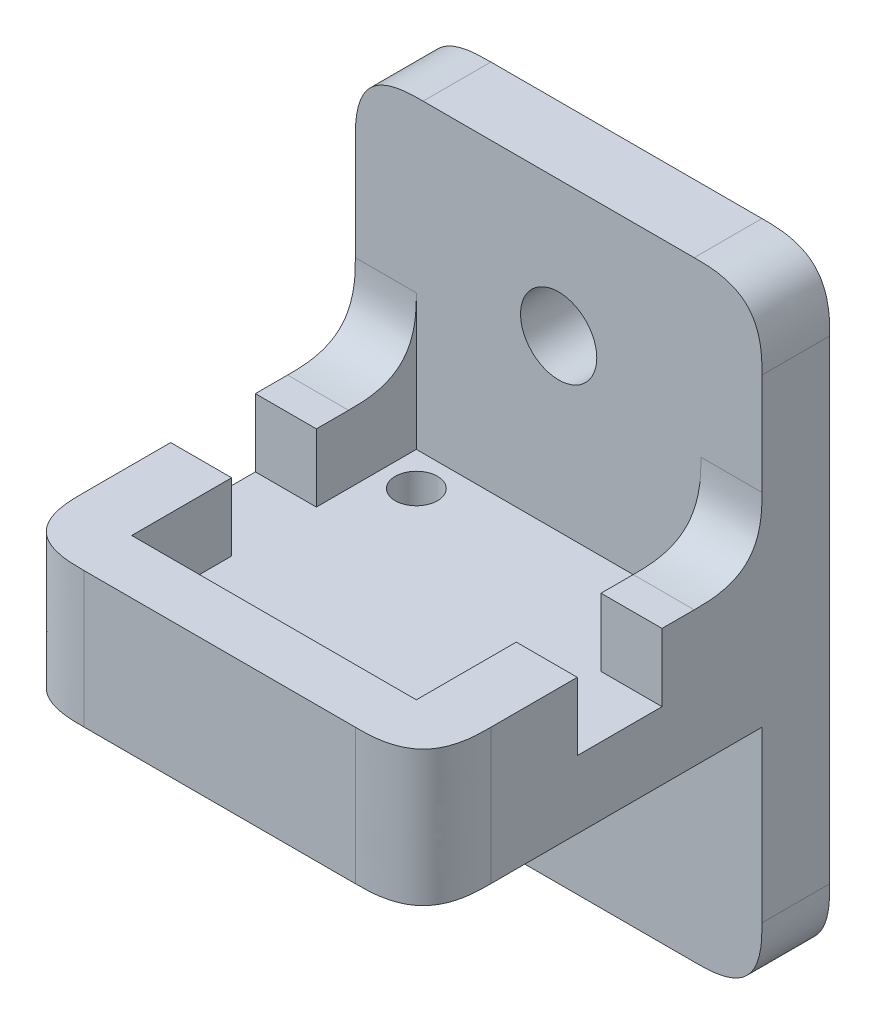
ISO-10303-21;
HEADER;
FILE_DESCRIPTION(('STEP AP214'),'2;1');
FILE_NAME('part.step','',(''),(''),'','','');
FILE_SCHEMA(('AUTOMOTIVE_DESIGN { 1 0 10303 214 1 1 1 1 }'));
ENDSEC;
DATA;
#1=APPLICATION_CONTEXT('core data for automotive mechanical design processes');
#2=APPLICATION_PROTOCOL_DEFINITION('international standard','automotive_design',2000,#1);
#3=PRODUCT_CONTEXT('',#1,'mechanical');
#4=PRODUCT('Part','Part','',(#3));
#5=PRODUCT_RELATED_PRODUCT_CATEGORY('part','',(#4));
#6=PRODUCT_DEFINITION_FORMATION('','',#4);
#7=PRODUCT_DEFINITION_CONTEXT('part definition',#1,'design');
#8=PRODUCT_DEFINITION('design','',#6,#7);
#9=PRODUCT_DEFINITION_SHAPE('','',#8);
#10=(LENGTH_UNIT() NAMED_UNIT(*) SI_UNIT(.MILLI.,.METRE.));
#11=(NAMED_UNIT(*) PLANE_ANGLE_UNIT() SI_UNIT($,.RADIAN.));
#12=(NAMED_UNIT(*) SI_UNIT($,.STERADIAN.) SOLID_ANGLE_UNIT());
#13=UNCERTAINTY_MEASURE_WITH_UNIT(LENGTH_MEASURE(1.E-05),#10,'distance_accuracy_value','');
#14=(GEOMETRIC_REPRESENTATION_CONTEXT(3) GLOBAL_UNCERTAINTY_ASSIGNED_CONTEXT((#13)) GLOBAL_UNIT_ASSIGNED_CONTEXT((#10,
#11,#12)) REPRESENTATION_CONTEXT('',''));
#15=CARTESIAN_POINT('',(0.,0.,0.));
#16=DIRECTION('',(0.,0.,1.));
#17=DIRECTION('',(1.,0.,0.));
#18=AXIS2_PLACEMENT_3D('',#15,#16,#17);
#19=CARTESIAN_POINT('',(-19.05,6.35,38.1));
#20=DIRECTION('',(0.,-1.,0.));
#21=DIRECTION('',(0.,0.,-1.));
#22=AXIS2_PLACEMENT_3D('',#19,#20,#21);
#23=PLANE('',#22);
#24=DIRECTION('',(0.,0.,-1.));
#25=VECTOR('',#24,1.);
#26=CARTESIAN_POINT('',(19.05,6.35,38.1));
#27=LINE('',#26,#25);
#28=CARTESIAN_POINT('',(19.05,6.35,15.71625));
#29=VERTEX_POINT('',#28);
#30=CARTESIAN_POINT('',(19.05,6.35,12.7));
#31=VERTEX_POINT('',#30);
#32=EDGE_CURVE('E525',#29,#31,#27,.T.);
#33=ORIENTED_EDGE('',*,*,#32,.T.);
#34=CARTESIAN_POINT('',(13.04925,6.35,12.7));
#35=CARTESIAN_POINT('',(15.14475,6.35,12.7));
#36=CARTESIAN_POINT('',(17.24025,6.35,12.7));
#37=CARTESIAN_POINT('',(19.33575,6.35,12.7));
#38=B_SPLINE_CURVE_WITH_KNOTS('',3,(#34,#35,#36,#37),.UNSPECIFIED.,.F.,.F.,(4,4),(0.03209925,
0.03838575),.UNSPECIFIED.);
#39=CARTESIAN_POINT('',(13.335,6.35,12.7));
#40=VERTEX_POINT('',#39);
#41=EDGE_CURVE('E355',#31,#40,#38,.F.);
#42=ORIENTED_EDGE('',*,*,#41,.T.);
#43=DIRECTION('',(0.,0.,-1.));
#44=VECTOR('',#43,1.);
#45=CARTESIAN_POINT('',(13.335,6.35,0.));
#46=LINE('',#45,#44);
#47=CARTESIAN_POINT('',(13.335,6.35,15.71625));
#48=VERTEX_POINT('',#47);
#49=EDGE_CURVE('E331',#48,#40,#46,.T.);
#50=ORIENTED_EDGE('',*,*,#49,.F.);
#51=DIRECTION('',(-1.,0.,0.));
#52=VECTOR('',#51,1.);
#53=CARTESIAN_POINT('',(19.05,6.35,15.71625));
#54=LINE('',#53,#52);
#55=EDGE_CURVE('E288',#29,#48,#54,.T.);
#56=ORIENTED_EDGE('',*,*,#55,.F.);
#57=EDGE_LOOP('',(#33,#42,#50,#56));
#58=FACE_BOUND('',#57,.T.);
#59=ADVANCED_FACE('F41',(#58),#23,.F.);
#60=DIRECTION('',(0.,0.,-1.));
#61=VECTOR('',#60,1.);
#62=CARTESIAN_POINT('',(-13.335,6.35,0.));
#63=LINE('',#62,#61);
#64=CARTESIAN_POINT('',(-13.335,6.35,15.71625));
#65=VERTEX_POINT('',#64);
#66=CARTESIAN_POINT('',(-13.335,6.35,12.7));
#67=VERTEX_POINT('',#66);
#68=EDGE_CURVE('E337',#65,#67,#63,.T.);
#69=ORIENTED_EDGE('',*,*,#68,.T.);
#70=CARTESIAN_POINT('',(-19.33575,6.35,12.7));
#71=CARTESIAN_POINT('',(-17.240249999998,6.35,12.7));
#72=CARTESIAN_POINT('',(-15.1447499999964,6.35,12.7));
#73=CARTESIAN_POINT('',(-13.04925,6.35,12.7));
#74=B_SPLINE_CURVE_WITH_KNOTS('',3,(#70,#71,#72,#73),.UNSPECIFIED.,.F.,.F.,(4,4),
(-0.000285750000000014,0.00600074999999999),.UNSPECIFIED.);
#75=CARTESIAN_POINT('',(-19.05,6.35,12.7));
#76=VERTEX_POINT('',#75);
#77=EDGE_CURVE('E1141',#67,#76,#74,.F.);
#78=ORIENTED_EDGE('',*,*,#77,.T.);
#79=DIRECTION('',(0.,0.,-1.));
#80=VECTOR('',#79,1.);
#81=CARTESIAN_POINT('',(-19.05,6.35,38.1));
#82=LINE('',#81,#80);
#83=CARTESIAN_POINT('',(-19.05,6.35,15.71625));
#84=VERTEX_POINT('',#83);
#85=EDGE_CURVE('E423',#84,#76,#82,.T.);
#86=ORIENTED_EDGE('',*,*,#85,.F.);
#87=EDGE_CURVE('E291',#65,#84,#54,.T.);
#88=ORIENTED_EDGE('',*,*,#87,.F.);
#89=EDGE_LOOP('',(#69,#78,#86,#88));
#90=FACE_BOUND('',#89,.T.);
#91=ADVANCED_FACE('F376',(#90),#23,.F.);
#92=CARTESIAN_POINT('',(19.05,-28.575,6.35));
#93=DIRECTION('',(-1.,0.,0.));
#94=DIRECTION('',(0.,0.,1.));
#95=AXIS2_PLACEMENT_3D('',#92,#93,#94);
#96=PLANE('',#95);
#97=CARTESIAN_POINT('',(19.05,6.35,31.75));
#98=VERTEX_POINT('',#97);
#99=CARTESIAN_POINT('',(19.05,6.35,23.65375));
#100=VERTEX_POINT('',#99);
#101=EDGE_CURVE('E927',#98,#100,#27,.T.);
#102=ORIENTED_EDGE('',*,*,#101,.F.);
#103=CARTESIAN_POINT('',(19.05,-6.985,31.75));
#104=CARTESIAN_POINT('',(19.05,-2.32833333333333,31.75));
#105=CARTESIAN_POINT('',(19.05,2.32833333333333,31.75));
#106=CARTESIAN_POINT('',(19.05,6.985,31.75));
#107=B_SPLINE_CURVE_WITH_KNOTS('',3,(#103,#104,#105,#106),.UNSPECIFIED.,.F.,.F.,(4,4),
(-0.006985,0.006985),.UNSPECIFIED.);
#108=CARTESIAN_POINT('',(19.05,-6.35,31.75));
#109=VERTEX_POINT('',#108);
#110=EDGE_CURVE('E974',#98,#109,#107,.F.);
#111=ORIENTED_EDGE('',*,*,#110,.T.);
#112=DIRECTION('',(0.,0.,-1.));
#113=VECTOR('',#112,1.);
#114=CARTESIAN_POINT('',(19.05,-6.35,38.1));
#115=LINE('',#114,#113);
#116=CARTESIAN_POINT('',(19.05,-6.35,6.35));
#117=VERTEX_POINT('',#116);
#118=EDGE_CURVE('E395',#109,#117,#115,.T.);
#119=ORIENTED_EDGE('',*,*,#118,.T.);
#120=DIRECTION('',(0.,1.,0.));
#121=VECTOR('',#120,1.);
#122=CARTESIAN_POINT('',(19.05,-28.575,6.35));
#123=LINE('',#122,#121);
#124=CARTESIAN_POINT('',(19.05,-22.225,6.35));
#125=VERTEX_POINT('',#124);
#126=EDGE_CURVE('E407',#125,#117,#123,.T.);
#127=ORIENTED_EDGE('',*,*,#126,.F.);
#128=CARTESIAN_POINT('',(19.05,-22.225,-0.317499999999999));
#129=CARTESIAN_POINT('',(19.05,-22.225,2.01083333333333));
#130=CARTESIAN_POINT('',(19.05,-22.225,4.33916666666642));
#131=CARTESIAN_POINT('',(19.05,-22.225,6.6675));
#132=B_SPLINE_CURVE_WITH_KNOTS('',3,(#128,#129,#130,#131),.UNSPECIFIED.,.F.,.F.,(4,4),
(-0.0003175,0.0066675),.UNSPECIFIED.);
#133=CARTESIAN_POINT('',(19.05,-22.225,0.));
#134=VERTEX_POINT('',#133);
#135=EDGE_CURVE('E979',#125,#134,#132,.F.);
#136=ORIENTED_EDGE('',*,*,#135,.T.);
#137=DIRECTION('',(0.,1.,0.));
#138=VECTOR('',#137,1.);
#139=CARTESIAN_POINT('',(19.05,-28.575,0.));
#140=LINE('',#139,#138);
#141=CARTESIAN_POINT('',(19.05,22.225,0.));
#142=VERTEX_POINT('',#141);
#143=EDGE_CURVE('E1026',#134,#142,#140,.T.);
#144=ORIENTED_EDGE('',*,*,#143,.T.);
#145=CARTESIAN_POINT('',(19.05,22.225,6.6675));
#146=CARTESIAN_POINT('',(19.05,22.225,4.33916666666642));
#147=CARTESIAN_POINT('',(19.05,22.225,2.01083333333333));
#148=CARTESIAN_POINT('',(19.05,22.225,-0.317499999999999));
#149=B_SPLINE_CURVE_WITH_KNOTS('',3,(#145,#146,#147,#148),.UNSPECIFIED.,.F.,.F.,(4,4),
(-0.0003175,0.0066675),.UNSPECIFIED.);
#150=CARTESIAN_POINT('',(19.05,22.225,6.35));
#151=VERTEX_POINT('',#150);
#152=EDGE_CURVE('E826',#142,#151,#149,.F.);
#153=ORIENTED_EDGE('',*,*,#152,.T.);
#154=CARTESIAN_POINT('',(19.05,12.7,6.35));
#155=VERTEX_POINT('',#154);
#156=EDGE_CURVE('E944',#155,#151,#123,.T.);
#157=ORIENTED_EDGE('',*,*,#156,.F.);
#158=CARTESIAN_POINT('',(19.05,6.35,12.7));
#159=CARTESIAN_POINT('',(19.05,6.35,11.6319423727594));
#160=CARTESIAN_POINT('',(19.05,6.35,10.5638847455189));
#161=CARTESIAN_POINT('',(19.05,6.80524369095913,8.20987193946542));
#162=CARTESIAN_POINT('',(19.05,8.20987193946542,6.80524369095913));
#163=CARTESIAN_POINT('',(19.05,10.5638847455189,6.35));
#164=CARTESIAN_POINT('',(19.05,11.6319423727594,6.35));
#165=CARTESIAN_POINT('',(19.05,12.7,6.35));
#166=B_SPLINE_CURVE_WITH_KNOTS('',5,(#158,#159,#160,#161,#162,#163,#164,#165),.UNSPECIFIED.,.F.,
.F.,(6,2,6),(0.,0.5,1.),.UNSPECIFIED.);
#167=EDGE_CURVE('E613',#155,#31,#166,.F.);
#168=ORIENTED_EDGE('',*,*,#167,.T.);
#169=ORIENTED_EDGE('',*,*,#32,.F.);
#170=DIRECTION('',(0.,1.,0.));
#171=VECTOR('',#170,1.);
#172=CARTESIAN_POINT('',(19.05,0.,15.71625));
#173=LINE('',#172,#171);
#174=CARTESIAN_POINT('',(19.05,0.,15.71625));
#175=VERTEX_POINT('',#174);
#176=EDGE_CURVE('E248',#175,#29,#173,.T.);
#177=ORIENTED_EDGE('',*,*,#176,.F.);
#178=DIRECTION('',(0.,0.,1.));
#179=VECTOR('',#178,1.);
#180=CARTESIAN_POINT('',(19.05,0.,0.));
#181=LINE('',#180,#179);
#182=CARTESIAN_POINT('',(19.05,0.,23.65375));
#183=VERTEX_POINT('',#182);
#184=EDGE_CURVE('E270',#175,#183,#181,.T.);
#185=ORIENTED_EDGE('',*,*,#184,.T.);
#186=DIRECTION('',(0.,1.,0.));
#187=VECTOR('',#186,1.);
#188=CARTESIAN_POINT('',(19.05,0.,23.65375));
#189=LINE('',#188,#187);
#190=EDGE_CURVE('E277',#183,#100,#189,.T.);
#191=ORIENTED_EDGE('',*,*,#190,.T.);
#192=EDGE_LOOP('',(#102,#111,#119,#127,#136,#144,#153,#157,#168,#169,#177,#185,#191));
#193=FACE_BOUND('',#192,.T.);
#194=ADVANCED_FACE('F495',(#193),#96,.F.);
#195=CARTESIAN_POINT('',(-19.05,-28.575,6.35));
#196=DIRECTION('',(1.,0.,0.));
#197=DIRECTION('',(0.,0.,-1.));
#198=AXIS2_PLACEMENT_3D('',#195,#196,#197);
#199=PLANE('',#198);
#200=DIRECTION('',(0.,0.,-1.));
#201=VECTOR('',#200,1.);
#202=CARTESIAN_POINT('',(-19.05,-6.35,38.1));
#203=LINE('',#202,#201);
#204=CARTESIAN_POINT('',(-19.05,-6.35,31.75));
#205=VERTEX_POINT('',#204);
#206=CARTESIAN_POINT('',(-19.05,-6.35,6.35));
#207=VERTEX_POINT('',#206);
#208=EDGE_CURVE('E405',#205,#207,#203,.T.);
#209=ORIENTED_EDGE('',*,*,#208,.F.);
#210=CARTESIAN_POINT('',(-19.05,6.985,31.75));
#211=CARTESIAN_POINT('',(-19.05,2.32833333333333,31.75));
#212=CARTESIAN_POINT('',(-19.05,-2.32833333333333,31.75));
#213=CARTESIAN_POINT('',(-19.05,-6.985,31.75));
#214=B_SPLINE_CURVE_WITH_KNOTS('',3,(#210,#211,#212,#213),.UNSPECIFIED.,.F.,.F.,(4,4),
(-0.006985,0.006985),.UNSPECIFIED.);
#215=CARTESIAN_POINT('',(-19.05,6.35,31.75));
#216=VERTEX_POINT('',#215);
#217=EDGE_CURVE('E513',#205,#216,#214,.F.);
#218=ORIENTED_EDGE('',*,*,#217,.T.);
#219=CARTESIAN_POINT('',(-19.05,6.35,23.65375));
#220=VERTEX_POINT('',#219);
#221=EDGE_CURVE('E265',#216,#220,#82,.T.);
#222=ORIENTED_EDGE('',*,*,#221,.T.);
#223=DIRECTION('',(0.,1.,0.));
#224=VECTOR('',#223,1.);
#225=CARTESIAN_POINT('',(-19.05,0.,23.65375));
#226=LINE('',#225,#224);
#227=CARTESIAN_POINT('',(-19.05,0.,23.65375));
#228=VERTEX_POINT('',#227);
#229=EDGE_CURVE('E239',#228,#220,#226,.T.);
#230=ORIENTED_EDGE('',*,*,#229,.F.);
#231=DIRECTION('',(0.,0.,1.));
#232=VECTOR('',#231,1.);
#233=CARTESIAN_POINT('',(-19.05,0.,0.));
#234=LINE('',#233,#232);
#235=CARTESIAN_POINT('',(-19.05,0.,15.71625));
#236=VERTEX_POINT('',#235);
#237=EDGE_CURVE('E251',#236,#228,#234,.T.);
#238=ORIENTED_EDGE('',*,*,#237,.F.);
#239=DIRECTION('',(0.,1.,0.));
#240=VECTOR('',#239,1.);
#241=CARTESIAN_POINT('',(-19.05,0.,15.71625));
#242=LINE('',#241,#240);
#243=EDGE_CURVE('E267',#236,#84,#242,.T.);
#244=ORIENTED_EDGE('',*,*,#243,.T.);
#245=ORIENTED_EDGE('',*,*,#85,.T.);
#246=CARTESIAN_POINT('',(-19.05,12.7,6.35));
#247=CARTESIAN_POINT('',(-19.05,11.6319423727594,6.35));
#248=CARTESIAN_POINT('',(-19.05,10.5638847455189,6.35));
#249=CARTESIAN_POINT('',(-19.05,8.20987193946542,6.80524369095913));
#250=CARTESIAN_POINT('',(-19.05,6.80524369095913,8.20987193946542));
#251=CARTESIAN_POINT('',(-19.05,6.35,10.5638847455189));
#252=CARTESIAN_POINT('',(-19.05,6.35,11.6319423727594));
#253=CARTESIAN_POINT('',(-19.05,6.35,12.7));
#254=B_SPLINE_CURVE_WITH_KNOTS('',5,(#246,#247,#248,#249,#250,#251,#252,#253),.UNSPECIFIED.,.F.,
.F.,(6,2,6),(0.,0.5,1.),.UNSPECIFIED.);
#255=CARTESIAN_POINT('',(-19.05,12.7,6.35));
#256=VERTEX_POINT('',#255);
#257=EDGE_CURVE('E55',#76,#256,#254,.F.);
#258=ORIENTED_EDGE('',*,*,#257,.T.);
#259=DIRECTION('',(0.,-1.,0.));
#260=VECTOR('',#259,1.);
#261=CARTESIAN_POINT('',(-19.05,-28.575,6.35));
#262=LINE('',#261,#260);
#263=CARTESIAN_POINT('',(-19.05,22.225,6.35));
#264=VERTEX_POINT('',#263);
#265=EDGE_CURVE('E456',#264,#256,#262,.T.);
#266=ORIENTED_EDGE('',*,*,#265,.F.);
#267=CARTESIAN_POINT('',(-19.05,22.225,-0.317499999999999));
#268=CARTESIAN_POINT('',(-19.05,22.225,2.01083333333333));
#269=CARTESIAN_POINT('',(-19.05,22.225,4.33916666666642));
#270=CARTESIAN_POINT('',(-19.05,22.225,6.6675));
#271=B_SPLINE_CURVE_WITH_KNOTS('',3,(#267,#268,#269,#270),.UNSPECIFIED.,.F.,.F.,(4,4),
(-0.0003175,0.0066675),.UNSPECIFIED.);
#272=CARTESIAN_POINT('',(-19.05,22.225,0.));
#273=VERTEX_POINT('',#272);
#274=EDGE_CURVE('E480',#264,#273,#271,.F.);
#275=ORIENTED_EDGE('',*,*,#274,.T.);
#276=DIRECTION('',(0.,-1.,0.));
#277=VECTOR('',#276,1.);
#278=CARTESIAN_POINT('',(-19.05,-28.575,0.));
#279=LINE('',#278,#277);
#280=CARTESIAN_POINT('',(-19.05,-22.225,0.));
#281=VERTEX_POINT('',#280);
#282=EDGE_CURVE('E463',#273,#281,#279,.T.);
#283=ORIENTED_EDGE('',*,*,#282,.T.);
#284=CARTESIAN_POINT('',(-19.05,-22.225,6.6675));
#285=CARTESIAN_POINT('',(-19.05,-22.225,4.33916666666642));
#286=CARTESIAN_POINT('',(-19.05,-22.225,2.01083333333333));
#287=CARTESIAN_POINT('',(-19.05,-22.225,-0.317499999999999));
#288=B_SPLINE_CURVE_WITH_KNOTS('',3,(#284,#285,#286,#287),.UNSPECIFIED.,.F.,.F.,(4,4),
(-0.0003175,0.0066675),.UNSPECIFIED.);
#289=CARTESIAN_POINT('',(-19.05,-22.225,6.35));
#290=VERTEX_POINT('',#289);
#291=EDGE_CURVE('E519',#281,#290,#288,.F.);
#292=ORIENTED_EDGE('',*,*,#291,.T.);
#293=EDGE_CURVE('E462',#207,#290,#262,.T.);
#294=ORIENTED_EDGE('',*,*,#293,.F.);
#295=EDGE_LOOP('',(#209,#218,#222,#230,#238,#244,#245,#258,#266,#275,#283,#292,#294));
#296=FACE_BOUND('',#295,.T.);
#297=ADVANCED_FACE('F263',(#296),#199,.F.);
#298=CARTESIAN_POINT('',(-13.335,0.,0.));
#299=DIRECTION('',(1.,0.,0.));
#300=DIRECTION('',(0.,0.,-1.));
#301=AXIS2_PLACEMENT_3D('',#298,#299,#300);
#302=PLANE('',#301);
#303=ORIENTED_EDGE('',*,*,#68,.F.);
#304=DIRECTION('',(0.,-1.,0.));
#305=VECTOR('',#304,1.);
#306=CARTESIAN_POINT('',(-13.335,0.,15.71625));
#307=LINE('',#306,#305);
#308=CARTESIAN_POINT('',(-13.335,0.,15.71625));
#309=VERTEX_POINT('',#308);
#310=EDGE_CURVE('E306',#65,#309,#307,.T.);
#311=ORIENTED_EDGE('',*,*,#310,.T.);
#312=DIRECTION('',(0.,0.,-1.));
#313=VECTOR('',#312,1.);
#314=CARTESIAN_POINT('',(-13.335,0.,0.));
#315=LINE('',#314,#313);
#316=CARTESIAN_POINT('',(-13.335,0.,6.35));
#317=VERTEX_POINT('',#316);
#318=EDGE_CURVE('E324',#309,#317,#315,.T.);
#319=ORIENTED_EDGE('',*,*,#318,.T.);
#320=DIRECTION('',(0.,1.,0.));
#321=VECTOR('',#320,1.);
#322=CARTESIAN_POINT('',(-13.335,0.,6.35));
#323=LINE('',#322,#321);
#324=CARTESIAN_POINT('',(-13.335,12.7,6.35));
#325=VERTEX_POINT('',#324);
#326=EDGE_CURVE('E879',#317,#325,#323,.T.);
#327=ORIENTED_EDGE('',*,*,#326,.T.);
#328=CARTESIAN_POINT('',(-13.335,6.35,12.7));
#329=CARTESIAN_POINT('',(-13.335,6.35,11.6319423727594));
#330=CARTESIAN_POINT('',(-13.335,6.35,10.5638847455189));
#331=CARTESIAN_POINT('',(-13.335,6.80524369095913,8.20987193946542));
#332=CARTESIAN_POINT('',(-13.335,8.20987193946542,6.80524369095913));
#333=CARTESIAN_POINT('',(-13.335,10.5638847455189,6.35));
#334=CARTESIAN_POINT('',(-13.335,11.6319423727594,6.35));
#335=CARTESIAN_POINT('',(-13.335,12.7,6.35));
#336=B_SPLINE_CURVE_WITH_KNOTS('',5,(#328,#329,#330,#331,#332,#333,#334,#335),.UNSPECIFIED.,.F.,
.F.,(6,2,6),(0.,0.5,1.),.UNSPECIFIED.);
#337=EDGE_CURVE('E11',#325,#67,#336,.F.);
#338=ORIENTED_EDGE('',*,*,#337,.T.);
#339=EDGE_LOOP('',(#303,#311,#319,#327,#338));
#340=FACE_BOUND('',#339,.T.);
#341=ADVANCED_FACE('F494',(#340),#302,.T.);
#342=CARTESIAN_POINT('',(13.335,0.,0.));
#343=DIRECTION('',(1.,0.,0.));
#344=DIRECTION('',(0.,0.,-1.));
#345=AXIS2_PLACEMENT_3D('',#342,#343,#344);
#346=PLANE('',#345);
#347=DIRECTION('',(0.,-1.,0.));
#348=VECTOR('',#347,1.);
#349=CARTESIAN_POINT('',(13.335,0.,15.71625));
#350=LINE('',#349,#348);
#351=CARTESIAN_POINT('',(13.335,0.,15.71625));
#352=VERTEX_POINT('',#351);
#353=EDGE_CURVE('E303',#48,#352,#350,.T.);
#354=ORIENTED_EDGE('',*,*,#353,.F.);
#355=ORIENTED_EDGE('',*,*,#49,.T.);
#356=CARTESIAN_POINT('',(13.335,12.7,6.35));
#357=CARTESIAN_POINT('',(13.335,11.6319423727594,6.35));
#358=CARTESIAN_POINT('',(13.335,10.5638847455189,6.35));
#359=CARTESIAN_POINT('',(13.335,8.20987193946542,6.80524369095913));
#360=CARTESIAN_POINT('',(13.335,6.80524369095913,8.20987193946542));
#361=CARTESIAN_POINT('',(13.335,6.35,10.5638847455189));
#362=CARTESIAN_POINT('',(13.335,6.35,11.6319423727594));
#363=CARTESIAN_POINT('',(13.335,6.35,12.7));
#364=B_SPLINE_CURVE_WITH_KNOTS('',5,(#356,#357,#358,#359,#360,#361,#362,#363),.UNSPECIFIED.,.F.,
.F.,(6,2,6),(0.,0.5,1.),.UNSPECIFIED.);
#365=CARTESIAN_POINT('',(13.335,12.7,6.35));
#366=VERTEX_POINT('',#365);
#367=EDGE_CURVE('E593',#40,#366,#364,.F.);
#368=ORIENTED_EDGE('',*,*,#367,.T.);
#369=DIRECTION('',(0.,1.,0.));
#370=VECTOR('',#369,1.);
#371=CARTESIAN_POINT('',(13.335,0.,6.35));
#372=LINE('',#371,#370);
#373=CARTESIAN_POINT('',(13.335,0.,6.35));
#374=VERTEX_POINT('',#373);
#375=EDGE_CURVE('E871',#374,#366,#372,.T.);
#376=ORIENTED_EDGE('',*,*,#375,.F.);
#377=DIRECTION('',(0.,0.,-1.));
#378=VECTOR('',#377,1.);
#379=CARTESIAN_POINT('',(13.335,0.,0.));
#380=LINE('',#379,#378);
#381=EDGE_CURVE('E315',#352,#374,#380,.T.);
#382=ORIENTED_EDGE('',*,*,#381,.F.);
#383=EDGE_LOOP('',(#354,#355,#368,#376,#382));
#384=FACE_BOUND('',#383,.T.);
#385=ADVANCED_FACE('F374',(#384),#346,.F.);
#386=DIRECTION('',(-1.,0.,0.));
#387=VECTOR('',#386,1.);
#388=CARTESIAN_POINT('',(-19.05,6.35,38.1));
#389=LINE('',#388,#387);
#390=CARTESIAN_POINT('',(12.7,6.35,38.1));
#391=VERTEX_POINT('',#390);
#392=CARTESIAN_POINT('',(-12.7,6.35,38.1));
#393=VERTEX_POINT('',#392);
#394=EDGE_CURVE('E891',#391,#393,#389,.T.);
#395=ORIENTED_EDGE('',*,*,#394,.F.);
#396=CARTESIAN_POINT('',(19.05,6.35000000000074,31.75));
#397=CARTESIAN_POINT('',(19.05,6.35000000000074,32.8180576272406));
#398=CARTESIAN_POINT('',(19.05,6.35000000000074,33.8861152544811));
#399=CARTESIAN_POINT('',(18.5947563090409,6.34999999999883,36.2401280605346));
#400=CARTESIAN_POINT('',(17.1901280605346,6.34999999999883,37.6447563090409));
#401=CARTESIAN_POINT('',(14.8361152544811,6.35000000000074,38.1));
#402=CARTESIAN_POINT('',(13.7680576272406,6.35000000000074,38.1));
#403=CARTESIAN_POINT('',(12.7,6.35000000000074,38.1));
#404=B_SPLINE_CURVE_WITH_KNOTS('',5,(#396,#397,#398,#399,#400,#401,#402,#403),.UNSPECIFIED.,.F.,
.F.,(6,2,6),(0.,0.5,1.),.UNSPECIFIED.);
#405=EDGE_CURVE('E534',#391,#98,#404,.F.);
#406=ORIENTED_EDGE('',*,*,#405,.T.);
#407=ORIENTED_EDGE('',*,*,#101,.T.);
#408=DIRECTION('',(-1.,0.,0.));
#409=VECTOR('',#408,1.);
#410=CARTESIAN_POINT('',(19.05,6.35,23.65375));
#411=LINE('',#410,#409);
#412=CARTESIAN_POINT('',(13.335,6.35,23.65375));
#413=VERTEX_POINT('',#412);
#414=EDGE_CURVE('E292',#100,#413,#411,.T.);
#415=ORIENTED_EDGE('',*,*,#414,.T.);
#416=CARTESIAN_POINT('',(13.335,6.35,33.02));
#417=VERTEX_POINT('',#416);
#418=EDGE_CURVE('E332',#417,#413,#46,.T.);
#419=ORIENTED_EDGE('',*,*,#418,.F.);
#420=DIRECTION('',(1.,0.,0.));
#421=VECTOR('',#420,1.);
#422=CARTESIAN_POINT('',(0.,6.35,33.02));
#423=LINE('',#422,#421);
#424=CARTESIAN_POINT('',(-13.335,6.35,33.02));
#425=VERTEX_POINT('',#424);
#426=EDGE_CURVE('E310',#425,#417,#423,.T.);
#427=ORIENTED_EDGE('',*,*,#426,.F.);
#428=CARTESIAN_POINT('',(-13.335,6.35,23.65375));
#429=VERTEX_POINT('',#428);
#430=EDGE_CURVE('E316',#425,#429,#63,.T.);
#431=ORIENTED_EDGE('',*,*,#430,.T.);
#432=EDGE_CURVE('E295',#429,#220,#411,.T.);
#433=ORIENTED_EDGE('',*,*,#432,.T.);
#434=ORIENTED_EDGE('',*,*,#221,.F.);
#435=CARTESIAN_POINT('',(-12.7,6.35000000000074,38.1));
#436=CARTESIAN_POINT('',(-13.7680576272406,6.35000000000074,38.1));
#437=CARTESIAN_POINT('',(-14.8361152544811,6.35000000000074,38.1));
#438=CARTESIAN_POINT('',(-17.1901280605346,6.34999999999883,37.6447563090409));
#439=CARTESIAN_POINT('',(-18.5947563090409,6.34999999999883,36.2401280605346));
#440=CARTESIAN_POINT('',(-19.05,6.35000000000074,33.8861152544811));
#441=CARTESIAN_POINT('',(-19.05,6.35000000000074,32.8180576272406));
#442=CARTESIAN_POINT('',(-19.05,6.35000000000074,31.75));
#443=B_SPLINE_CURVE_WITH_KNOTS('',5,(#435,#436,#437,#438,#439,#440,#441,#442),.UNSPECIFIED.,.F.,
.F.,(6,2,6),(0.,0.5,1.),.UNSPECIFIED.);
#444=EDGE_CURVE('E521',#216,#393,#443,.F.);
#445=ORIENTED_EDGE('',*,*,#444,.T.);
#446=EDGE_LOOP('',(#395,#406,#407,#415,#419,#427,#431,#433,#434,#445));
#447=FACE_BOUND('',#446,.T.);
#448=ADVANCED_FACE('F363',(#447),#23,.F.);
#449=CARTESIAN_POINT('',(0.,0.,6.35));
#450=DIRECTION('',(0.,0.,-1.));
#451=DIRECTION('',(-1.,0.,0.));
#452=AXIS2_PLACEMENT_3D('',#449,#450,#451);
#453=PLANE('',#452);
#454=CARTESIAN_POINT('',(0.,-15.875,6.35));
#455=DIRECTION('',(0.,0.,1.));
#456=DIRECTION('',(1.,0.,0.));
#457=AXIS2_PLACEMENT_3D('',#454,#455,#456);
#458=CIRCLE('',#457,3.571875);
#459=CARTESIAN_POINT('',(3.57187499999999,-15.875,6.35));
#460=VERTEX_POINT('',#459);
#461=EDGE_CURVE('E937',#460,#460,#458,.T.);
#462=ORIENTED_EDGE('',*,*,#461,.F.);
#463=EDGE_LOOP('',(#462));
#464=FACE_BOUND('',#463,.T.);
#465=ORIENTED_EDGE('',*,*,#293,.T.);
#466=CARTESIAN_POINT('',(-12.7,-28.575,6.35));
#467=CARTESIAN_POINT('',(-13.7680576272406,-28.575,6.35));
#468=CARTESIAN_POINT('',(-14.8361152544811,-28.575,6.35));
#469=CARTESIAN_POINT('',(-17.1901280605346,-28.1197563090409,6.35));
#470=CARTESIAN_POINT('',(-18.5947563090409,-26.7151280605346,6.35));
#471=CARTESIAN_POINT('',(-19.05,-24.3611152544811,6.35));
#472=CARTESIAN_POINT('',(-19.05,-23.2930576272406,6.35));
#473=CARTESIAN_POINT('',(-19.05,-22.225,6.35));
#474=B_SPLINE_CURVE_WITH_KNOTS('',5,(#466,#467,#468,#469,#470,#471,#472,#473),.UNSPECIFIED.,.F.,
.F.,(6,2,6),(0.,0.5,1.),.UNSPECIFIED.);
#475=CARTESIAN_POINT('',(-12.7,-28.575,6.35));
#476=VERTEX_POINT('',#475);
#477=EDGE_CURVE('E719',#290,#476,#474,.F.);
#478=ORIENTED_EDGE('',*,*,#477,.T.);
#479=DIRECTION('',(1.,0.,0.));
#480=VECTOR('',#479,1.);
#481=CARTESIAN_POINT('',(-19.05,-28.575,6.35));
#482=LINE('',#481,#480);
#483=CARTESIAN_POINT('',(12.7,-28.575,6.35));
#484=VERTEX_POINT('',#483);
#485=EDGE_CURVE('E461',#476,#484,#482,.T.);
#486=ORIENTED_EDGE('',*,*,#485,.T.);
#487=CARTESIAN_POINT('',(19.05,-22.225,6.35));
#488=CARTESIAN_POINT('',(19.05,-23.2930576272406,6.35));
#489=CARTESIAN_POINT('',(19.05,-24.3611152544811,6.35));
#490=CARTESIAN_POINT('',(18.5947563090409,-26.7151280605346,6.35));
#491=CARTESIAN_POINT('',(17.1901280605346,-28.1197563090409,6.35));
#492=CARTESIAN_POINT('',(14.8361152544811,-28.575,6.35));
#493=CARTESIAN_POINT('',(13.7680576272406,-28.575,6.35));
#494=CARTESIAN_POINT('',(12.7,-28.575,6.35));
#495=B_SPLINE_CURVE_WITH_KNOTS('',5,(#487,#488,#489,#490,#491,#492,#493,#494),.UNSPECIFIED.,.F.,
.F.,(6,2,6),(0.,0.5,1.),.UNSPECIFIED.);
#496=EDGE_CURVE('E1215',#484,#125,#495,.F.);
#497=ORIENTED_EDGE('',*,*,#496,.T.);
#498=ORIENTED_EDGE('',*,*,#126,.T.);
#499=DIRECTION('',(1.,0.,0.));
#500=VECTOR('',#499,1.);
#501=CARTESIAN_POINT('',(-19.05,-6.35,6.35));
#502=LINE('',#501,#500);
#503=EDGE_CURVE('E413',#207,#117,#502,.T.);
#504=ORIENTED_EDGE('',*,*,#503,.F.);
#505=EDGE_LOOP('',(#465,#478,#486,#497,#498,#504));
#506=FACE_BOUND('',#505,.T.);
#507=ADVANCED_FACE('F373',(#464,#506),#453,.F.);
#508=CARTESIAN_POINT('',(0.,15.875,6.35));
#509=DIRECTION('',(0.,0.,1.));
#510=DIRECTION('',(1.,0.,0.));
#511=AXIS2_PLACEMENT_3D('',#508,#509,#510);
#512=CIRCLE('',#511,3.571875);
#513=CARTESIAN_POINT('',(3.57187499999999,15.875,6.35));
#514=VERTEX_POINT('',#513);
#515=EDGE_CURVE('E1029',#514,#514,#512,.T.);
#516=ORIENTED_EDGE('',*,*,#515,.F.);
#517=EDGE_LOOP('',(#516));
#518=FACE_BOUND('',#517,.T.);
#519=ORIENTED_EDGE('',*,*,#375,.T.);
#520=CARTESIAN_POINT('',(19.33575,12.7,6.35));
#521=CARTESIAN_POINT('',(17.24025,12.7,6.35));
#522=CARTESIAN_POINT('',(15.14475,12.7,6.35));
#523=CARTESIAN_POINT('',(13.04925,12.7,6.35));
#524=B_SPLINE_CURVE_WITH_KNOTS('',3,(#520,#521,#522,#523),.UNSPECIFIED.,.F.,.F.,(4,4),
(0.03209925,0.03838575),.UNSPECIFIED.);
#525=EDGE_CURVE('E623',#366,#155,#524,.F.);
#526=ORIENTED_EDGE('',*,*,#525,.T.);
#527=ORIENTED_EDGE('',*,*,#156,.T.);
#528=CARTESIAN_POINT('',(12.7,28.575,6.35));
#529=CARTESIAN_POINT('',(13.7680576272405,28.575,6.35));
#530=CARTESIAN_POINT('',(14.8361152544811,28.575,6.35));
#531=CARTESIAN_POINT('',(17.1901280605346,28.1197563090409,6.35));
#532=CARTESIAN_POINT('',(18.5947563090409,26.7151280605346,6.35));
#533=CARTESIAN_POINT('',(19.05,24.3611152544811,6.35));
#534=CARTESIAN_POINT('',(19.05,23.2930576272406,6.35));
#535=CARTESIAN_POINT('',(19.05,22.225,6.35));
#536=B_SPLINE_CURVE_WITH_KNOTS('',5,(#528,#529,#530,#531,#532,#533,#534,#535),.UNSPECIFIED.,.F.,
.F.,(6,2,6),(0.,0.5,1.),.UNSPECIFIED.);
#537=CARTESIAN_POINT('',(12.7,28.575,6.35));
#538=VERTEX_POINT('',#537);
#539=EDGE_CURVE('E816',#151,#538,#536,.F.);
#540=ORIENTED_EDGE('',*,*,#539,.T.);
#541=DIRECTION('',(-1.,0.,0.));
#542=VECTOR('',#541,1.);
#543=CARTESIAN_POINT('',(-19.05,28.575,6.35));
#544=LINE('',#543,#542);
#545=CARTESIAN_POINT('',(-12.7,28.575,6.35));
#546=VERTEX_POINT('',#545);
#547=EDGE_CURVE('E360',#538,#546,#544,.T.);
#548=ORIENTED_EDGE('',*,*,#547,.T.);
#549=CARTESIAN_POINT('',(-19.05,22.225,6.35));
#550=CARTESIAN_POINT('',(-19.05,23.2930576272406,6.35));
#551=CARTESIAN_POINT('',(-19.05,24.3611152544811,6.35));
#552=CARTESIAN_POINT('',(-18.5947563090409,26.7151280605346,6.35));
#553=CARTESIAN_POINT('',(-17.1901280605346,28.1197563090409,6.35));
#554=CARTESIAN_POINT('',(-14.8361152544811,28.575,6.35));
#555=CARTESIAN_POINT('',(-13.7680576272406,28.575,6.35));
#556=CARTESIAN_POINT('',(-12.7,28.575,6.35));
#557=B_SPLINE_CURVE_WITH_KNOTS('',5,(#549,#550,#551,#552,#553,#554,#555,#556),.UNSPECIFIED.,.F.,
.F.,(6,2,6),(0.,0.5,1.),.UNSPECIFIED.);
#558=EDGE_CURVE('E857',#546,#264,#557,.F.);
#559=ORIENTED_EDGE('',*,*,#558,.T.);
#560=ORIENTED_EDGE('',*,*,#265,.T.);
#561=CARTESIAN_POINT('',(-13.04925,12.7,6.35));
#562=CARTESIAN_POINT('',(-15.1447499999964,12.7,6.35));
#563=CARTESIAN_POINT('',(-17.240249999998,12.7,6.35));
#564=CARTESIAN_POINT('',(-19.33575,12.7,6.35));
#565=B_SPLINE_CURVE_WITH_KNOTS('',3,(#561,#562,#563,#564),.UNSPECIFIED.,.F.,.F.,(4,4),
(-0.000285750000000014,0.00600074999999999),.UNSPECIFIED.);
#566=EDGE_CURVE('E684',#256,#325,#565,.F.);
#567=ORIENTED_EDGE('',*,*,#566,.T.);
#568=ORIENTED_EDGE('',*,*,#326,.F.);
#569=DIRECTION('',(-1.,0.,0.));
#570=VECTOR('',#569,1.);
#571=CARTESIAN_POINT('',(0.,0.,6.35));
#572=LINE('',#571,#570);
#573=EDGE_CURVE('E320',#374,#317,#572,.T.);
#574=ORIENTED_EDGE('',*,*,#573,.F.);
#575=EDGE_LOOP('',(#519,#526,#527,#540,#548,#559,#560,#567,#568,#574));
#576=FACE_BOUND('',#575,.T.);
#577=ADVANCED_FACE('F1186',(#518,#576),#453,.F.);
#578=CARTESIAN_POINT('',(0.,0.,0.));
#579=DIRECTION('',(0.,0.,-1.));
#580=DIRECTION('',(-1.,0.,0.));
#581=AXIS2_PLACEMENT_3D('',#578,#579,#580);
#582=PLANE('',#581);
#583=CARTESIAN_POINT('',(0.,15.875,0.));
#584=DIRECTION('',(0.,0.,1.));
#585=DIRECTION('',(1.,0.,0.));
#586=AXIS2_PLACEMENT_3D('',#583,#584,#585);
#587=CIRCLE('',#586,3.571875);
#588=CARTESIAN_POINT('',(3.57187499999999,15.875,0.));
#589=VERTEX_POINT('',#588);
#590=EDGE_CURVE('E1032',#589,#589,#587,.T.);
#591=ORIENTED_EDGE('',*,*,#590,.T.);
#592=EDGE_LOOP('',(#591));
#593=FACE_BOUND('',#592,.T.);
#594=DIRECTION('',(1.,0.,0.));
#595=VECTOR('',#594,1.);
#596=CARTESIAN_POINT('',(-19.05,-28.575,0.));
#597=LINE('',#596,#595);
#598=CARTESIAN_POINT('',(-12.7,-28.575,0.));
#599=VERTEX_POINT('',#598);
#600=CARTESIAN_POINT('',(12.7,-28.575,0.));
#601=VERTEX_POINT('',#600);
#602=EDGE_CURVE('E1019',#599,#601,#597,.T.);
#603=ORIENTED_EDGE('',*,*,#602,.F.);
#604=CARTESIAN_POINT('',(-19.05,-22.225,0.));
#605=CARTESIAN_POINT('',(-19.05,-23.2930576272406,0.));
#606=CARTESIAN_POINT('',(-19.05,-24.3611152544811,0.));
#607=CARTESIAN_POINT('',(-18.5947563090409,-26.7151280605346,0.));
#608=CARTESIAN_POINT('',(-17.1901280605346,-28.1197563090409,0.));
#609=CARTESIAN_POINT('',(-14.8361152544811,-28.575,0.));
#610=CARTESIAN_POINT('',(-13.7680576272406,-28.575,0.));
#611=CARTESIAN_POINT('',(-12.7,-28.575,0.));
#612=B_SPLINE_CURVE_WITH_KNOTS('',5,(#604,#605,#606,#607,#608,#609,#610,#611),.UNSPECIFIED.,.F.,
.F.,(6,2,6),(0.,0.5,1.),.UNSPECIFIED.);
#613=EDGE_CURVE('E697',#599,#281,#612,.F.);
#614=ORIENTED_EDGE('',*,*,#613,.T.);
#615=ORIENTED_EDGE('',*,*,#282,.F.);
#616=CARTESIAN_POINT('',(-12.7,28.575,0.));
#617=CARTESIAN_POINT('',(-13.7680576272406,28.575,0.));
#618=CARTESIAN_POINT('',(-14.8361152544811,28.575,0.));
#619=CARTESIAN_POINT('',(-17.1901280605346,28.1197563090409,0.));
#620=CARTESIAN_POINT('',(-18.5947563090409,26.7151280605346,0.));
#621=CARTESIAN_POINT('',(-19.05,24.3611152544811,0.));
#622=CARTESIAN_POINT('',(-19.05,23.2930576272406,0.));
#623=CARTESIAN_POINT('',(-19.05,22.225,0.));
#624=B_SPLINE_CURVE_WITH_KNOTS('',5,(#616,#617,#618,#619,#620,#621,#622,#623),.UNSPECIFIED.,.F.,
.F.,(6,2,6),(0.,0.5,1.),.UNSPECIFIED.);
#625=CARTESIAN_POINT('',(-12.7,28.575,0.));
#626=VERTEX_POINT('',#625);
#627=EDGE_CURVE('E62',#273,#626,#624,.F.);
#628=ORIENTED_EDGE('',*,*,#627,.T.);
#629=DIRECTION('',(-1.,0.,0.));
#630=VECTOR('',#629,1.);
#631=CARTESIAN_POINT('',(-19.05,28.575,0.));
#632=LINE('',#631,#630);
#633=CARTESIAN_POINT('',(12.7,28.575,0.));
#634=VERTEX_POINT('',#633);
#635=EDGE_CURVE('E1024',#634,#626,#632,.T.);
#636=ORIENTED_EDGE('',*,*,#635,.F.);
#637=CARTESIAN_POINT('',(19.05,22.225,0.));
#638=CARTESIAN_POINT('',(19.05,23.2930576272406,0.));
#639=CARTESIAN_POINT('',(19.05,24.3611152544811,0.));
#640=CARTESIAN_POINT('',(18.5947563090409,26.7151280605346,0.));
#641=CARTESIAN_POINT('',(17.1901280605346,28.1197563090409,0.));
#642=CARTESIAN_POINT('',(14.8361152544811,28.575,0.));
#643=CARTESIAN_POINT('',(13.7680576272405,28.575,0.));
#644=CARTESIAN_POINT('',(12.7,28.575,0.));
#645=B_SPLINE_CURVE_WITH_KNOTS('',5,(#637,#638,#639,#640,#641,#642,#643,#644),.UNSPECIFIED.,.F.,
.F.,(6,2,6),(0.,0.5,1.),.UNSPECIFIED.);
#646=EDGE_CURVE('E71',#634,#142,#645,.F.);
#647=ORIENTED_EDGE('',*,*,#646,.T.);
#648=ORIENTED_EDGE('',*,*,#143,.F.);
#649=CARTESIAN_POINT('',(12.7,-28.575,0.));
#650=CARTESIAN_POINT('',(13.7680576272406,-28.575,0.));
#651=CARTESIAN_POINT('',(14.8361152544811,-28.575,0.));
#652=CARTESIAN_POINT('',(17.1901280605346,-28.1197563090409,0.));
#653=CARTESIAN_POINT('',(18.5947563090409,-26.7151280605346,0.));
#654=CARTESIAN_POINT('',(19.05,-24.3611152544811,0.));
#655=CARTESIAN_POINT('',(19.05,-23.2930576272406,0.));
#656=CARTESIAN_POINT('',(19.05,-22.225,0.));
#657=B_SPLINE_CURVE_WITH_KNOTS('',5,(#649,#650,#651,#652,#653,#654,#655,#656),.UNSPECIFIED.,.F.,
.F.,(6,2,6),(0.,0.5,1.),.UNSPECIFIED.);
#658=EDGE_CURVE('E741',#134,#601,#657,.F.);
#659=ORIENTED_EDGE('',*,*,#658,.T.);
#660=EDGE_LOOP('',(#603,#614,#615,#628,#636,#647,#648,#659));
#661=FACE_BOUND('',#660,.T.);
#662=CARTESIAN_POINT('',(0.,-15.875,0.));
#663=DIRECTION('',(0.,0.,1.));
#664=DIRECTION('',(1.,0.,0.));
#665=AXIS2_PLACEMENT_3D('',#662,#663,#664);
#666=CIRCLE('',#665,3.571875);
#667=CARTESIAN_POINT('',(3.57187499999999,-15.875,0.));
#668=VERTEX_POINT('',#667);
#669=EDGE_CURVE('E934',#668,#668,#666,.T.);
#670=ORIENTED_EDGE('',*,*,#669,.T.);
#671=EDGE_LOOP('',(#670));
#672=FACE_BOUND('',#671,.T.);
#673=ADVANCED_FACE('F1044',(#593,#661,#672),#582,.T.);
#674=CARTESIAN_POINT('',(-19.05,28.575,6.35));
#675=DIRECTION('',(0.,-1.,0.));
#676=DIRECTION('',(1.,0.,0.));
#677=AXIS2_PLACEMENT_3D('',#674,#675,#676);
#678=PLANE('',#677);
#679=ORIENTED_EDGE('',*,*,#547,.F.);
#680=CARTESIAN_POINT('',(12.7,28.575,-0.317499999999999));
#681=CARTESIAN_POINT('',(12.7,28.575,2.01083333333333));
#682=CARTESIAN_POINT('',(12.7,28.575,4.33916666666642));
#683=CARTESIAN_POINT('',(12.7,28.575,6.6675));
#684=B_SPLINE_CURVE_WITH_KNOTS('',3,(#680,#681,#682,#683),.UNSPECIFIED.,.F.,.F.,(4,4),
(-0.0003175,0.0066675),.UNSPECIFIED.);
#685=EDGE_CURVE('E806',#538,#634,#684,.F.);
#686=ORIENTED_EDGE('',*,*,#685,.T.);
#687=ORIENTED_EDGE('',*,*,#635,.T.);
#688=CARTESIAN_POINT('',(-12.7,28.575,6.6675));
#689=CARTESIAN_POINT('',(-12.7,28.575,4.33916666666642));
#690=CARTESIAN_POINT('',(-12.7,28.575,2.01083333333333));
#691=CARTESIAN_POINT('',(-12.7,28.575,-0.317499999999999));
#692=B_SPLINE_CURVE_WITH_KNOTS('',3,(#688,#689,#690,#691),.UNSPECIFIED.,.F.,.F.,(4,4),
(-0.0003175,0.0066675),.UNSPECIFIED.);
#693=EDGE_CURVE('E867',#626,#546,#692,.F.);
#694=ORIENTED_EDGE('',*,*,#693,.T.);
#695=EDGE_LOOP('',(#679,#686,#687,#694));
#696=FACE_BOUND('',#695,.T.);
#697=ADVANCED_FACE('F499',(#696),#678,.F.);
#698=CARTESIAN_POINT('',(-19.05,-28.575,6.35));
#699=DIRECTION('',(0.,1.,0.));
#700=DIRECTION('',(0.,0.,1.));
#701=AXIS2_PLACEMENT_3D('',#698,#699,#700);
#702=PLANE('',#701);
#703=ORIENTED_EDGE('',*,*,#485,.F.);
#704=CARTESIAN_POINT('',(-12.7,-28.575,-0.317499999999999));
#705=CARTESIAN_POINT('',(-12.7,-28.575,2.01083333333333));
#706=CARTESIAN_POINT('',(-12.7,-28.575,4.33916666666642));
#707=CARTESIAN_POINT('',(-12.7,-28.575,6.6675));
#708=B_SPLINE_CURVE_WITH_KNOTS('',3,(#704,#705,#706,#707),.UNSPECIFIED.,.F.,.F.,(4,4),
(-0.0003175,0.0066675),.UNSPECIFIED.);
#709=EDGE_CURVE('E709',#476,#599,#708,.F.);
#710=ORIENTED_EDGE('',*,*,#709,.T.);
#711=ORIENTED_EDGE('',*,*,#602,.T.);
#712=CARTESIAN_POINT('',(12.7,-28.575,6.6675));
#713=CARTESIAN_POINT('',(12.7,-28.575,4.33916666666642));
#714=CARTESIAN_POINT('',(12.7,-28.575,2.01083333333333));
#715=CARTESIAN_POINT('',(12.7,-28.575,-0.317499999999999));
#716=B_SPLINE_CURVE_WITH_KNOTS('',3,(#712,#713,#714,#715),.UNSPECIFIED.,.F.,.F.,(4,4),
(-0.0003175,0.0066675),.UNSPECIFIED.);
#717=EDGE_CURVE('E787',#601,#484,#716,.F.);
#718=ORIENTED_EDGE('',*,*,#717,.T.);
#719=EDGE_LOOP('',(#703,#710,#711,#718));
#720=FACE_BOUND('',#719,.T.);
#721=ADVANCED_FACE('F496',(#720),#702,.F.);
#722=CARTESIAN_POINT('',(0.,15.875,6.35));
#723=DIRECTION('',(0.,0.,-1.));
#724=DIRECTION('',(-1.,0.,0.));
#725=AXIS2_PLACEMENT_3D('',#722,#723,#724);
#726=CYLINDRICAL_SURFACE('',#725,3.571875);
#727=ORIENTED_EDGE('',*,*,#515,.T.);
#728=EDGE_LOOP('',(#727));
#729=FACE_BOUND('',#728,.T.);
#730=ORIENTED_EDGE('',*,*,#590,.F.);
#731=EDGE_LOOP('',(#730));
#732=FACE_BOUND('',#731,.T.);
#733=ADVANCED_FACE('F1047',(#729,#732),#726,.F.);
#734=CARTESIAN_POINT('',(0.,-15.875,6.35));
#735=DIRECTION('',(0.,0.,-1.));
#736=DIRECTION('',(-1.,0.,0.));
#737=AXIS2_PLACEMENT_3D('',#734,#735,#736);
#738=CYLINDRICAL_SURFACE('',#737,3.571875);
#739=ORIENTED_EDGE('',*,*,#461,.T.);
#740=EDGE_LOOP('',(#739));
#741=FACE_BOUND('',#740,.T.);
#742=ORIENTED_EDGE('',*,*,#669,.F.);
#743=EDGE_LOOP('',(#742));
#744=FACE_BOUND('',#743,.T.);
#745=ADVANCED_FACE('F380',(#741,#744),#738,.F.);
#746=CARTESIAN_POINT('',(-19.05,-6.35,38.1));
#747=DIRECTION('',(0.,1.,0.));
#748=DIRECTION('',(0.,0.,1.));
#749=AXIS2_PLACEMENT_3D('',#746,#747,#748);
#750=PLANE('',#749);
#751=CARTESIAN_POINT('',(10.16,-6.35,29.845));
#752=DIRECTION('',(0.,1.,0.));
#753=DIRECTION('',(0.,0.,1.));
#754=AXIS2_PLACEMENT_3D('',#751,#752,#753);
#755=CIRCLE('',#754,1.984375);
#756=CARTESIAN_POINT('',(10.16,-6.35,31.829375));
#757=VERTEX_POINT('',#756);
#758=EDGE_CURVE('E260',#757,#757,#755,.T.);
#759=ORIENTED_EDGE('',*,*,#758,.T.);
#760=EDGE_LOOP('',(#759));
#761=FACE_BOUND('',#760,.T.);
#762=CARTESIAN_POINT('',(-10.16,-6.35,29.845));
#763=DIRECTION('',(0.,1.,0.));
#764=DIRECTION('',(0.,0.,1.));
#765=AXIS2_PLACEMENT_3D('',#762,#763,#764);
#766=CIRCLE('',#765,1.984375);
#767=CARTESIAN_POINT('',(-10.16,-6.35,31.829375));
#768=VERTEX_POINT('',#767);
#769=EDGE_CURVE('E1561',#768,#768,#766,.T.);
#770=ORIENTED_EDGE('',*,*,#769,.T.);
#771=EDGE_LOOP('',(#770));
#772=FACE_BOUND('',#771,.T.);
#773=CARTESIAN_POINT('',(-10.16,-6.35,9.525));
#774=DIRECTION('',(0.,1.,0.));
#775=DIRECTION('',(0.,0.,1.));
#776=AXIS2_PLACEMENT_3D('',#773,#774,#775);
#777=CIRCLE('',#776,1.984375);
#778=CARTESIAN_POINT('',(-10.16,-6.35,11.509375));
#779=VERTEX_POINT('',#778);
#780=EDGE_CURVE('E1556',#779,#779,#777,.T.);
#781=ORIENTED_EDGE('',*,*,#780,.T.);
#782=EDGE_LOOP('',(#781));
#783=FACE_BOUND('',#782,.T.);
#784=CARTESIAN_POINT('',(10.16,-6.35,9.525));
#785=DIRECTION('',(0.,1.,0.));
#786=DIRECTION('',(0.,0.,1.));
#787=AXIS2_PLACEMENT_3D('',#784,#785,#786);
#788=CIRCLE('',#787,1.984375);
#789=CARTESIAN_POINT('',(10.16,-6.35,11.509375));
#790=VERTEX_POINT('',#789);
#791=EDGE_CURVE('E1553',#790,#790,#788,.T.);
#792=ORIENTED_EDGE('',*,*,#791,.T.);
#793=EDGE_LOOP('',(#792));
#794=FACE_BOUND('',#793,.T.);
#795=ORIENTED_EDGE('',*,*,#118,.F.);
#796=CARTESIAN_POINT('',(12.7,-6.35000000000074,38.1));
#797=CARTESIAN_POINT('',(13.7680576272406,-6.35000000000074,38.1));
#798=CARTESIAN_POINT('',(14.8361152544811,-6.35000000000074,38.1));
#799=CARTESIAN_POINT('',(17.1901280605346,-6.34999999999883,37.6447563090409));
#800=CARTESIAN_POINT('',(18.5947563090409,-6.34999999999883,36.2401280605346));
#801=CARTESIAN_POINT('',(19.05,-6.35000000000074,33.8861152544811));
#802=CARTESIAN_POINT('',(19.05,-6.35000000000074,32.8180576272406));
#803=CARTESIAN_POINT('',(19.05,-6.35000000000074,31.75));
#804=B_SPLINE_CURVE_WITH_KNOTS('',5,(#796,#797,#798,#799,#800,#801,#802,#803),.UNSPECIFIED.,.F.,
.F.,(6,2,6),(0.,0.5,1.),.UNSPECIFIED.);
#805=CARTESIAN_POINT('',(12.7,-6.35,38.1));
#806=VERTEX_POINT('',#805);
#807=EDGE_CURVE('E443',#109,#806,#804,.F.);
#808=ORIENTED_EDGE('',*,*,#807,.T.);
#809=DIRECTION('',(1.,0.,0.));
#810=VECTOR('',#809,1.);
#811=CARTESIAN_POINT('',(-19.05,-6.35,38.1));
#812=LINE('',#811,#810);
#813=CARTESIAN_POINT('',(-12.7,-6.35,38.1));
#814=VERTEX_POINT('',#813);
#815=EDGE_CURVE('E406',#814,#806,#812,.T.);
#816=ORIENTED_EDGE('',*,*,#815,.F.);
#817=CARTESIAN_POINT('',(-19.05,-6.35000000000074,31.75));
#818=CARTESIAN_POINT('',(-19.05,-6.35000000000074,32.8180576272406));
#819=CARTESIAN_POINT('',(-19.05,-6.35000000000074,33.8861152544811));
#820=CARTESIAN_POINT('',(-18.5947563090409,-6.34999999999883,36.2401280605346));
#821=CARTESIAN_POINT('',(-17.1901280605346,-6.34999999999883,37.6447563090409));
#822=CARTESIAN_POINT('',(-14.8361152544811,-6.35000000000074,38.1));
#823=CARTESIAN_POINT('',(-13.7680576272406,-6.35000000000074,38.1));
#824=CARTESIAN_POINT('',(-12.7,-6.35000000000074,38.1));
#825=B_SPLINE_CURVE_WITH_KNOTS('',5,(#817,#818,#819,#820,#821,#822,#823,#824),.UNSPECIFIED.,.F.,
.F.,(6,2,6),(0.,0.5,1.),.UNSPECIFIED.);
#826=EDGE_CURVE('E431',#814,#205,#825,.F.);
#827=ORIENTED_EDGE('',*,*,#826,.T.);
#828=ORIENTED_EDGE('',*,*,#208,.T.);
#829=ORIENTED_EDGE('',*,*,#503,.T.);
#830=EDGE_LOOP('',(#795,#808,#816,#827,#828,#829));
#831=FACE_BOUND('',#830,.T.);
#832=ADVANCED_FACE('F377',(#761,#772,#783,#794,#831),#750,.F.);
#833=CARTESIAN_POINT('',(0.,0.,38.1));
#834=DIRECTION('',(0.,0.,-1.));
#835=DIRECTION('',(-1.,0.,0.));
#836=AXIS2_PLACEMENT_3D('',#833,#834,#835);
#837=PLANE('',#836);
#838=ORIENTED_EDGE('',*,*,#815,.T.);
#839=CARTESIAN_POINT('',(12.7,6.985,38.1));
#840=CARTESIAN_POINT('',(12.7,2.32833333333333,38.1));
#841=CARTESIAN_POINT('',(12.7,-2.32833333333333,38.1));
#842=CARTESIAN_POINT('',(12.7,-6.985,38.1));
#843=B_SPLINE_CURVE_WITH_KNOTS('',3,(#839,#840,#841,#842),.UNSPECIFIED.,.F.,.F.,(4,4),
(-0.006985,0.006985),.UNSPECIFIED.);
#844=EDGE_CURVE('E535',#806,#391,#843,.F.);
#845=ORIENTED_EDGE('',*,*,#844,.T.);
#846=ORIENTED_EDGE('',*,*,#394,.T.);
#847=CARTESIAN_POINT('',(-12.7,-6.985,38.1));
#848=CARTESIAN_POINT('',(-12.7,-2.32833333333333,38.1));
#849=CARTESIAN_POINT('',(-12.7,2.32833333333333,38.1));
#850=CARTESIAN_POINT('',(-12.7,6.985,38.1));
#851=B_SPLINE_CURVE_WITH_KNOTS('',3,(#847,#848,#849,#850),.UNSPECIFIED.,.F.,.F.,(4,4),
(-0.006985,0.006985),.UNSPECIFIED.);
#852=EDGE_CURVE('E531',#393,#814,#851,.F.);
#853=ORIENTED_EDGE('',*,*,#852,.T.);
#854=EDGE_LOOP('',(#838,#845,#846,#853));
#855=FACE_BOUND('',#854,.T.);
#856=ADVANCED_FACE('F912',(#855),#837,.F.);
#857=CARTESIAN_POINT('',(0.,0.,33.02));
#858=DIRECTION('',(0.,0.,1.));
#859=DIRECTION('',(1.,0.,0.));
#860=AXIS2_PLACEMENT_3D('',#857,#858,#859);
#861=PLANE('',#860);
#862=ORIENTED_EDGE('',*,*,#426,.T.);
#863=DIRECTION('',(0.,1.,0.));
#864=VECTOR('',#863,1.);
#865=CARTESIAN_POINT('',(13.335,0.,33.02));
#866=LINE('',#865,#864);
#867=CARTESIAN_POINT('',(13.335,0.,33.02));
#868=VERTEX_POINT('',#867);
#869=EDGE_CURVE('E328',#868,#417,#866,.T.);
#870=ORIENTED_EDGE('',*,*,#869,.F.);
#871=DIRECTION('',(1.,0.,0.));
#872=VECTOR('',#871,1.);
#873=CARTESIAN_POINT('',(0.,0.,33.02));
#874=LINE('',#873,#872);
#875=CARTESIAN_POINT('',(-13.335,0.,33.02));
#876=VERTEX_POINT('',#875);
#877=EDGE_CURVE('E311',#876,#868,#874,.T.);
#878=ORIENTED_EDGE('',*,*,#877,.F.);
#879=DIRECTION('',(0.,1.,0.));
#880=VECTOR('',#879,1.);
#881=CARTESIAN_POINT('',(-13.335,0.,33.02));
#882=LINE('',#881,#880);
#883=EDGE_CURVE('E882',#876,#425,#882,.T.);
#884=ORIENTED_EDGE('',*,*,#883,.T.);
#885=EDGE_LOOP('',(#862,#870,#878,#884));
#886=FACE_BOUND('',#885,.T.);
#887=ADVANCED_FACE('F921',(#886),#861,.F.);
#888=DIRECTION('',(0.,-1.,0.));
#889=VECTOR('',#888,1.);
#890=CARTESIAN_POINT('',(-13.335,0.,23.65375));
#891=LINE('',#890,#889);
#892=CARTESIAN_POINT('',(-13.335,0.,23.65375));
#893=VERTEX_POINT('',#892);
#894=EDGE_CURVE('E242',#429,#893,#891,.T.);
#895=ORIENTED_EDGE('',*,*,#894,.F.);
#896=ORIENTED_EDGE('',*,*,#430,.F.);
#897=ORIENTED_EDGE('',*,*,#883,.F.);
#898=EDGE_CURVE('E325',#876,#893,#315,.T.);
#899=ORIENTED_EDGE('',*,*,#898,.T.);
#900=EDGE_LOOP('',(#895,#896,#897,#899));
#901=FACE_BOUND('',#900,.T.);
#902=ADVANCED_FACE('F1093',(#901),#302,.T.);
#903=ORIENTED_EDGE('',*,*,#418,.T.);
#904=DIRECTION('',(0.,-1.,0.));
#905=VECTOR('',#904,1.);
#906=CARTESIAN_POINT('',(13.335,0.,23.65375));
#907=LINE('',#906,#905);
#908=CARTESIAN_POINT('',(13.335,0.,23.65375));
#909=VERTEX_POINT('',#908);
#910=EDGE_CURVE('E287',#413,#909,#907,.T.);
#911=ORIENTED_EDGE('',*,*,#910,.T.);
#912=EDGE_CURVE('E317',#868,#909,#380,.T.);
#913=ORIENTED_EDGE('',*,*,#912,.F.);
#914=ORIENTED_EDGE('',*,*,#869,.T.);
#915=EDGE_LOOP('',(#903,#911,#913,#914));
#916=FACE_BOUND('',#915,.T.);
#917=ADVANCED_FACE('F1102',(#916),#346,.F.);
#918=CARTESIAN_POINT('',(0.,0.,0.));
#919=DIRECTION('',(0.,1.,0.));
#920=DIRECTION('',(0.,0.,1.));
#921=AXIS2_PLACEMENT_3D('',#918,#919,#920);
#922=PLANE('',#921);
#923=CARTESIAN_POINT('',(10.16,0.,29.845));
#924=DIRECTION('',(0.,1.,0.));
#925=DIRECTION('',(0.,0.,1.));
#926=AXIS2_PLACEMENT_3D('',#923,#924,#925);
#927=CIRCLE('',#926,1.984375);
#928=CARTESIAN_POINT('',(10.16,0.,31.829375));
#929=VERTEX_POINT('',#928);
#930=EDGE_CURVE('E1579',#929,#929,#927,.T.);
#931=ORIENTED_EDGE('',*,*,#930,.F.);
#932=EDGE_LOOP('',(#931));
#933=FACE_BOUND('',#932,.T.);
#934=CARTESIAN_POINT('',(-10.16,0.,29.845));
#935=DIRECTION('',(0.,1.,0.));
#936=DIRECTION('',(0.,0.,1.));
#937=AXIS2_PLACEMENT_3D('',#934,#935,#936);
#938=CIRCLE('',#937,1.984375);
#939=CARTESIAN_POINT('',(-10.16,0.,31.829375));
#940=VERTEX_POINT('',#939);
#941=EDGE_CURVE('E1583',#940,#940,#938,.T.);
#942=ORIENTED_EDGE('',*,*,#941,.F.);
#943=EDGE_LOOP('',(#942));
#944=FACE_BOUND('',#943,.T.);
#945=CARTESIAN_POINT('',(-10.16,0.,9.525));
#946=DIRECTION('',(0.,1.,0.));
#947=DIRECTION('',(0.,0.,1.));
#948=AXIS2_PLACEMENT_3D('',#945,#946,#947);
#949=CIRCLE('',#948,1.984375);
#950=CARTESIAN_POINT('',(-10.16,0.,11.509375));
#951=VERTEX_POINT('',#950);
#952=EDGE_CURVE('E1563',#951,#951,#949,.T.);
#953=ORIENTED_EDGE('',*,*,#952,.F.);
#954=EDGE_LOOP('',(#953));
#955=FACE_BOUND('',#954,.T.);
#956=CARTESIAN_POINT('',(10.16,0.,9.525));
#957=DIRECTION('',(0.,1.,0.));
#958=DIRECTION('',(0.,0.,1.));
#959=AXIS2_PLACEMENT_3D('',#956,#957,#958);
#960=CIRCLE('',#959,1.984375);
#961=CARTESIAN_POINT('',(10.16,0.,11.509375));
#962=VERTEX_POINT('',#961);
#963=EDGE_CURVE('E1550',#962,#962,#960,.T.);
#964=ORIENTED_EDGE('',*,*,#963,.F.);
#965=EDGE_LOOP('',(#964));
#966=FACE_BOUND('',#965,.T.);
#967=ORIENTED_EDGE('',*,*,#912,.T.);
#968=DIRECTION('',(-1.,0.,0.));
#969=VECTOR('',#968,1.);
#970=CARTESIAN_POINT('',(19.05,0.,23.65375));
#971=LINE('',#970,#969);
#972=EDGE_CURVE('E247',#183,#909,#971,.T.);
#973=ORIENTED_EDGE('',*,*,#972,.F.);
#974=ORIENTED_EDGE('',*,*,#184,.F.);
#975=DIRECTION('',(-1.,0.,0.));
#976=VECTOR('',#975,1.);
#977=CARTESIAN_POINT('',(19.05,0.,15.71625));
#978=LINE('',#977,#976);
#979=EDGE_CURVE('E283',#175,#352,#978,.T.);
#980=ORIENTED_EDGE('',*,*,#979,.T.);
#981=ORIENTED_EDGE('',*,*,#381,.T.);
#982=ORIENTED_EDGE('',*,*,#573,.T.);
#983=ORIENTED_EDGE('',*,*,#318,.F.);
#984=EDGE_CURVE('E255',#309,#236,#978,.T.);
#985=ORIENTED_EDGE('',*,*,#984,.T.);
#986=ORIENTED_EDGE('',*,*,#237,.T.);
#987=EDGE_CURVE('E235',#893,#228,#971,.T.);
#988=ORIENTED_EDGE('',*,*,#987,.F.);
#989=ORIENTED_EDGE('',*,*,#898,.F.);
#990=ORIENTED_EDGE('',*,*,#877,.T.);
#991=EDGE_LOOP('',(#967,#973,#974,#980,#981,#982,#983,#985,#986,#988,#989,#990));
#992=FACE_BOUND('',#991,.T.);
#993=ADVANCED_FACE('F253',(#933,#944,#955,#966,#992),#922,.T.);
#994=CARTESIAN_POINT('',(19.05,0.,15.71625));
#995=DIRECTION('',(0.,0.,1.));
#996=DIRECTION('',(1.,0.,0.));
#997=AXIS2_PLACEMENT_3D('',#994,#995,#996);
#998=PLANE('',#997);
#999=ORIENTED_EDGE('',*,*,#353,.T.);
#1000=ORIENTED_EDGE('',*,*,#979,.F.);
#1001=ORIENTED_EDGE('',*,*,#176,.T.);
#1002=ORIENTED_EDGE('',*,*,#55,.T.);
#1003=EDGE_LOOP('',(#999,#1000,#1001,#1002));
#1004=FACE_BOUND('',#1003,.T.);
#1005=ADVANCED_FACE('F1111',(#1004),#998,.T.);
#1006=CARTESIAN_POINT('',(19.05,0.,23.65375));
#1007=DIRECTION('',(0.,0.,1.));
#1008=DIRECTION('',(1.,0.,0.));
#1009=AXIS2_PLACEMENT_3D('',#1006,#1007,#1008);
#1010=PLANE('',#1009);
#1011=ORIENTED_EDGE('',*,*,#414,.F.);
#1012=ORIENTED_EDGE('',*,*,#190,.F.);
#1013=ORIENTED_EDGE('',*,*,#972,.T.);
#1014=ORIENTED_EDGE('',*,*,#910,.F.);
#1015=EDGE_LOOP('',(#1011,#1012,#1013,#1014));
#1016=FACE_BOUND('',#1015,.T.);
#1017=ADVANCED_FACE('F1126',(#1016),#1010,.F.);
#1018=ORIENTED_EDGE('',*,*,#87,.T.);
#1019=ORIENTED_EDGE('',*,*,#243,.F.);
#1020=ORIENTED_EDGE('',*,*,#984,.F.);
#1021=ORIENTED_EDGE('',*,*,#310,.F.);
#1022=EDGE_LOOP('',(#1018,#1019,#1020,#1021));
#1023=FACE_BOUND('',#1022,.T.);
#1024=ADVANCED_FACE('F1395',(#1023),#998,.T.);
#1025=ORIENTED_EDGE('',*,*,#894,.T.);
#1026=ORIENTED_EDGE('',*,*,#987,.T.);
#1027=ORIENTED_EDGE('',*,*,#229,.T.);
#1028=ORIENTED_EDGE('',*,*,#432,.F.);
#1029=EDGE_LOOP('',(#1025,#1026,#1027,#1028));
#1030=FACE_BOUND('',#1029,.T.);
#1031=ADVANCED_FACE('F237',(#1030),#1010,.F.);
#1032=CARTESIAN_POINT('',(10.16,-28.575,9.525));
#1033=DIRECTION('',(0.,1.,0.));
#1034=DIRECTION('',(0.,0.,1.));
#1035=AXIS2_PLACEMENT_3D('',#1032,#1033,#1034);
#1036=CYLINDRICAL_SURFACE('',#1035,1.984375);
#1037=ORIENTED_EDGE('',*,*,#963,.T.);
#1038=EDGE_LOOP('',(#1037));
#1039=FACE_BOUND('',#1038,.T.);
#1040=ORIENTED_EDGE('',*,*,#791,.F.);
#1041=EDGE_LOOP('',(#1040));
#1042=FACE_BOUND('',#1041,.T.);
#1043=ADVANCED_FACE('F1367',(#1039,#1042),#1036,.F.);
#1044=CARTESIAN_POINT('',(-10.16,-28.575,9.525));
#1045=DIRECTION('',(0.,1.,0.));
#1046=DIRECTION('',(0.,0.,1.));
#1047=AXIS2_PLACEMENT_3D('',#1044,#1045,#1046);
#1048=CYLINDRICAL_SURFACE('',#1047,1.984375);
#1049=ORIENTED_EDGE('',*,*,#952,.T.);
#1050=EDGE_LOOP('',(#1049));
#1051=FACE_BOUND('',#1050,.T.);
#1052=ORIENTED_EDGE('',*,*,#780,.F.);
#1053=EDGE_LOOP('',(#1052));
#1054=FACE_BOUND('',#1053,.T.);
#1055=ADVANCED_FACE('F1357',(#1051,#1054),#1048,.F.);
#1056=CARTESIAN_POINT('',(-10.16,-28.575,29.845));
#1057=DIRECTION('',(0.,1.,0.));
#1058=DIRECTION('',(0.,0.,1.));
#1059=AXIS2_PLACEMENT_3D('',#1056,#1057,#1058);
#1060=CYLINDRICAL_SURFACE('',#1059,1.984375);
#1061=ORIENTED_EDGE('',*,*,#941,.T.);
#1062=EDGE_LOOP('',(#1061));
#1063=FACE_BOUND('',#1062,.T.);
#1064=ORIENTED_EDGE('',*,*,#769,.F.);
#1065=EDGE_LOOP('',(#1064));
#1066=FACE_BOUND('',#1065,.T.);
#1067=ADVANCED_FACE('F1345',(#1063,#1066),#1060,.F.);
#1068=CARTESIAN_POINT('',(10.16,-28.575,29.845));
#1069=DIRECTION('',(0.,1.,0.));
#1070=DIRECTION('',(0.,0.,1.));
#1071=AXIS2_PLACEMENT_3D('',#1068,#1069,#1070);
#1072=CYLINDRICAL_SURFACE('',#1071,1.984375);
#1073=ORIENTED_EDGE('',*,*,#930,.T.);
#1074=EDGE_LOOP('',(#1073));
#1075=FACE_BOUND('',#1074,.T.);
#1076=ORIENTED_EDGE('',*,*,#758,.F.);
#1077=EDGE_LOOP('',(#1076));
#1078=FACE_BOUND('',#1077,.T.);
#1079=ADVANCED_FACE('F1340',(#1075,#1078),#1072,.F.);
#1080=CARTESIAN_POINT('',(12.7,-6.985,38.1));
#1081=CARTESIAN_POINT('',(12.7,-2.32833333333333,38.1));
#1082=CARTESIAN_POINT('',(12.7,2.32833333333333,38.1));
#1083=CARTESIAN_POINT('',(12.7,6.985,38.1));
#1084=CARTESIAN_POINT('',(13.7680576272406,-6.985,38.1));
#1085=CARTESIAN_POINT('',(13.7680576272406,-2.32833333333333,38.1));
#1086=CARTESIAN_POINT('',(13.7680576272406,2.32833333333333,38.1));
#1087=CARTESIAN_POINT('',(13.7680576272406,6.985,38.1));
#1088=CARTESIAN_POINT('',(14.8361152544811,-6.985,38.1));
#1089=CARTESIAN_POINT('',(14.8361152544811,-2.32833333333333,38.1));
#1090=CARTESIAN_POINT('',(14.8361152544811,2.32833333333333,38.1));
#1091=CARTESIAN_POINT('',(14.8361152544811,6.985,38.1));
#1092=CARTESIAN_POINT('',(17.1901280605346,-6.985,37.6447563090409));
#1093=CARTESIAN_POINT('',(17.1901280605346,-2.32833333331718,37.6447563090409));
#1094=CARTESIAN_POINT('',(17.1901280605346,2.32833333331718,37.6447563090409));
#1095=CARTESIAN_POINT('',(17.1901280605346,6.985,37.6447563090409));
#1096=CARTESIAN_POINT('',(18.5947563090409,-6.985,36.2401280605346));
#1097=CARTESIAN_POINT('',(18.5947563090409,-2.32833333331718,36.2401280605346));
#1098=CARTESIAN_POINT('',(18.5947563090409,2.32833333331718,36.2401280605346));
#1099=CARTESIAN_POINT('',(18.5947563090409,6.985,36.2401280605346));
#1100=CARTESIAN_POINT('',(19.05,-6.985,33.8861152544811));
#1101=CARTESIAN_POINT('',(19.05,-2.32833333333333,33.8861152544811));
#1102=CARTESIAN_POINT('',(19.05,2.32833333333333,33.8861152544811));
#1103=CARTESIAN_POINT('',(19.05,6.985,33.8861152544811));
#1104=CARTESIAN_POINT('',(19.05,-6.985,32.8180576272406));
#1105=CARTESIAN_POINT('',(19.05,-2.32833333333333,32.8180576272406));
#1106=CARTESIAN_POINT('',(19.05,2.32833333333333,32.8180576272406));
#1107=CARTESIAN_POINT('',(19.05,6.985,32.8180576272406));
#1108=CARTESIAN_POINT('',(19.05,-6.985,31.75));
#1109=CARTESIAN_POINT('',(19.05,-2.32833333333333,31.75));
#1110=CARTESIAN_POINT('',(19.05,2.32833333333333,31.75));
#1111=CARTESIAN_POINT('',(19.05,6.985,31.75));
#1112=B_SPLINE_SURFACE_WITH_KNOTS('',5,3,((#1080,#1081,#1082,#1083),(#1084,#1085,#1086,#1087),
(#1088,#1089,#1090,#1091),(#1092,#1093,#1094,#1095),(#1096,#1097,#1098,#1099),(#1100,#1101,
#1102,#1103),(#1104,#1105,#1106,#1107),(#1108,#1109,#1110,#1111)),.UNSPECIFIED.,.F.,.F.,.F.,(6,
2,6),(4,4),(0.,0.5,1.),(-0.006985,0.006985),.UNSPECIFIED.);
#1113=ORIENTED_EDGE('',*,*,#807,.F.);
#1114=ORIENTED_EDGE('',*,*,#110,.F.);
#1115=ORIENTED_EDGE('',*,*,#405,.F.);
#1116=ORIENTED_EDGE('',*,*,#844,.F.);
#1117=EDGE_LOOP('',(#1113,#1114,#1115,#1116));
#1118=FACE_BOUND('',#1117,.T.);
#1119=ADVANCED_FACE('F561',(#1118),#1112,.T.);
#1120=CARTESIAN_POINT('',(-12.7,6.985,38.1));
#1121=CARTESIAN_POINT('',(-12.7,2.32833333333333,38.1));
#1122=CARTESIAN_POINT('',(-12.7,-2.32833333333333,38.1));
#1123=CARTESIAN_POINT('',(-12.7,-6.985,38.1));
#1124=CARTESIAN_POINT('',(-13.7680576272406,6.985,38.1));
#1125=CARTESIAN_POINT('',(-13.7680576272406,2.32833333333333,38.1));
#1126=CARTESIAN_POINT('',(-13.7680576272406,-2.32833333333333,38.1));
#1127=CARTESIAN_POINT('',(-13.7680576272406,-6.985,38.1));
#1128=CARTESIAN_POINT('',(-14.8361152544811,6.985,38.1));
#1129=CARTESIAN_POINT('',(-14.8361152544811,2.32833333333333,38.1));
#1130=CARTESIAN_POINT('',(-14.8361152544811,-2.32833333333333,38.1));
#1131=CARTESIAN_POINT('',(-14.8361152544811,-6.985,38.1));
#1132=CARTESIAN_POINT('',(-17.1901280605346,6.985,37.6447563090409));
#1133=CARTESIAN_POINT('',(-17.1901280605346,2.32833333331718,37.6447563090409));
#1134=CARTESIAN_POINT('',(-17.1901280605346,-2.32833333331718,37.6447563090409));
#1135=CARTESIAN_POINT('',(-17.1901280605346,-6.985,37.6447563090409));
#1136=CARTESIAN_POINT('',(-18.5947563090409,6.985,36.2401280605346));
#1137=CARTESIAN_POINT('',(-18.5947563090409,2.32833333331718,36.2401280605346));
#1138=CARTESIAN_POINT('',(-18.5947563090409,-2.32833333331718,36.2401280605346));
#1139=CARTESIAN_POINT('',(-18.5947563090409,-6.985,36.2401280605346));
#1140=CARTESIAN_POINT('',(-19.05,6.985,33.8861152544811));
#1141=CARTESIAN_POINT('',(-19.05,2.32833333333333,33.8861152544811));
#1142=CARTESIAN_POINT('',(-19.05,-2.32833333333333,33.8861152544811));
#1143=CARTESIAN_POINT('',(-19.05,-6.985,33.8861152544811));
#1144=CARTESIAN_POINT('',(-19.05,6.985,32.8180576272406));
#1145=CARTESIAN_POINT('',(-19.05,2.32833333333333,32.8180576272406));
#1146=CARTESIAN_POINT('',(-19.05,-2.32833333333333,32.8180576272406));
#1147=CARTESIAN_POINT('',(-19.05,-6.985,32.8180576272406));
#1148=CARTESIAN_POINT('',(-19.05,6.985,31.75));
#1149=CARTESIAN_POINT('',(-19.05,2.32833333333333,31.75));
#1150=CARTESIAN_POINT('',(-19.05,-2.32833333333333,31.75));
#1151=CARTESIAN_POINT('',(-19.05,-6.985,31.75));
#1152=B_SPLINE_SURFACE_WITH_KNOTS('',5,3,((#1120,#1121,#1122,#1123),(#1124,#1125,#1126,#1127),
(#1128,#1129,#1130,#1131),(#1132,#1133,#1134,#1135),(#1136,#1137,#1138,#1139),(#1140,#1141,
#1142,#1143),(#1144,#1145,#1146,#1147),(#1148,#1149,#1150,#1151)),.UNSPECIFIED.,.F.,.F.,.F.,(6,
2,6),(4,4),(0.,0.5,1.),(-0.006985,0.006985),.UNSPECIFIED.);
#1153=ORIENTED_EDGE('',*,*,#444,.F.);
#1154=ORIENTED_EDGE('',*,*,#217,.F.);
#1155=ORIENTED_EDGE('',*,*,#826,.F.);
#1156=ORIENTED_EDGE('',*,*,#852,.F.);
#1157=EDGE_LOOP('',(#1153,#1154,#1155,#1156));
#1158=FACE_BOUND('',#1157,.T.);
#1159=ADVANCED_FACE('F529',(#1158),#1152,.T.);
#1160=CARTESIAN_POINT('',(13.04925,12.7,6.35));
#1161=CARTESIAN_POINT('',(15.14475,12.7,6.35));
#1162=CARTESIAN_POINT('',(17.24025,12.7,6.35));
#1163=CARTESIAN_POINT('',(19.33575,12.7,6.35));
#1164=CARTESIAN_POINT('',(13.04925,11.6319423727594,6.35));
#1165=CARTESIAN_POINT('',(15.14475,11.6319423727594,6.35));
#1166=CARTESIAN_POINT('',(17.24025,11.6319423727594,6.35));
#1167=CARTESIAN_POINT('',(19.33575,11.6319423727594,6.35));
#1168=CARTESIAN_POINT('',(13.04925,10.5638847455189,6.35));
#1169=CARTESIAN_POINT('',(15.14475,10.5638847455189,6.35));
#1170=CARTESIAN_POINT('',(17.24025,10.5638847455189,6.35));
#1171=CARTESIAN_POINT('',(19.33575,10.5638847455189,6.35));
#1172=CARTESIAN_POINT('',(13.04925,8.20987193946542,6.80524369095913));
#1173=CARTESIAN_POINT('',(15.14475,8.20987193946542,6.80524369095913));
#1174=CARTESIAN_POINT('',(17.24025,8.20987193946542,6.80524369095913));
#1175=CARTESIAN_POINT('',(19.33575,8.20987193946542,6.80524369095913));
#1176=CARTESIAN_POINT('',(13.04925,6.80524369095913,8.20987193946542));
#1177=CARTESIAN_POINT('',(15.14475,6.80524369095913,8.20987193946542));
#1178=CARTESIAN_POINT('',(17.24025,6.80524369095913,8.20987193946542));
#1179=CARTESIAN_POINT('',(19.33575,6.80524369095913,8.20987193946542));
#1180=CARTESIAN_POINT('',(13.04925,6.35,10.5638847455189));
#1181=CARTESIAN_POINT('',(15.14475,6.35,10.5638847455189));
#1182=CARTESIAN_POINT('',(17.24025,6.35,10.5638847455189));
#1183=CARTESIAN_POINT('',(19.33575,6.35,10.5638847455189));
#1184=CARTESIAN_POINT('',(13.04925,6.35,11.6319423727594));
#1185=CARTESIAN_POINT('',(15.14475,6.35,11.6319423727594));
#1186=CARTESIAN_POINT('',(17.24025,6.35,11.6319423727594));
#1187=CARTESIAN_POINT('',(19.33575,6.35,11.6319423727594));
#1188=CARTESIAN_POINT('',(13.04925,6.35,12.7));
#1189=CARTESIAN_POINT('',(15.14475,6.35,12.7));
#1190=CARTESIAN_POINT('',(17.24025,6.35,12.7));
#1191=CARTESIAN_POINT('',(19.33575,6.35,12.7));
#1192=B_SPLINE_SURFACE_WITH_KNOTS('',5,3,((#1160,#1161,#1162,#1163),(#1164,#1165,#1166,#1167),
(#1168,#1169,#1170,#1171),(#1172,#1173,#1174,#1175),(#1176,#1177,#1178,#1179),(#1180,#1181,
#1182,#1183),(#1184,#1185,#1186,#1187),(#1188,#1189,#1190,#1191)),.UNSPECIFIED.,.F.,.F.,.F.,(6,
2,6),(4,4),(0.,0.5,1.),(0.03209925,0.03838575),.UNSPECIFIED.);
#1193=ORIENTED_EDGE('',*,*,#167,.F.);
#1194=ORIENTED_EDGE('',*,*,#525,.F.);
#1195=ORIENTED_EDGE('',*,*,#367,.F.);
#1196=ORIENTED_EDGE('',*,*,#41,.F.);
#1197=EDGE_LOOP('',(#1193,#1194,#1195,#1196));
#1198=FACE_BOUND('',#1197,.T.);
#1199=ADVANCED_FACE('F560',(#1198),#1192,.T.);
#1200=CARTESIAN_POINT('',(-19.33575,12.7,6.35));
#1201=CARTESIAN_POINT('',(-17.240249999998,12.7,6.35));
#1202=CARTESIAN_POINT('',(-15.1447499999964,12.7,6.35));
#1203=CARTESIAN_POINT('',(-13.04925,12.7,6.35));
#1204=CARTESIAN_POINT('',(-19.33575,11.6319423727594,6.35));
#1205=CARTESIAN_POINT('',(-17.240249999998,11.6319423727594,6.35));
#1206=CARTESIAN_POINT('',(-15.1447499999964,11.6319423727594,6.35));
#1207=CARTESIAN_POINT('',(-13.04925,11.6319423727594,6.35));
#1208=CARTESIAN_POINT('',(-19.33575,10.5638847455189,6.35));
#1209=CARTESIAN_POINT('',(-17.240249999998,10.5638847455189,6.35));
#1210=CARTESIAN_POINT('',(-15.1447499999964,10.5638847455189,6.35));
#1211=CARTESIAN_POINT('',(-13.04925,10.5638847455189,6.35));
#1212=CARTESIAN_POINT('',(-19.33575,8.20987193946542,6.80524369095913));
#1213=CARTESIAN_POINT('',(-17.240249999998,8.20987193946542,6.80524369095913));
#1214=CARTESIAN_POINT('',(-15.1447499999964,8.20987193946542,6.80524369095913));
#1215=CARTESIAN_POINT('',(-13.04925,8.20987193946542,6.80524369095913));
#1216=CARTESIAN_POINT('',(-19.33575,6.80524369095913,8.20987193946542));
#1217=CARTESIAN_POINT('',(-17.240249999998,6.80524369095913,8.20987193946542));
#1218=CARTESIAN_POINT('',(-15.1447499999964,6.80524369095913,8.20987193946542));
#1219=CARTESIAN_POINT('',(-13.04925,6.80524369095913,8.20987193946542));
#1220=CARTESIAN_POINT('',(-19.33575,6.35,10.5638847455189));
#1221=CARTESIAN_POINT('',(-17.240249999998,6.35,10.5638847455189));
#1222=CARTESIAN_POINT('',(-15.1447499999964,6.35,10.5638847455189));
#1223=CARTESIAN_POINT('',(-13.04925,6.35,10.5638847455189));
#1224=CARTESIAN_POINT('',(-19.33575,6.35,11.6319423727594));
#1225=CARTESIAN_POINT('',(-17.240249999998,6.35,11.6319423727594));
#1226=CARTESIAN_POINT('',(-15.1447499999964,6.35,11.6319423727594));
#1227=CARTESIAN_POINT('',(-13.04925,6.35,11.6319423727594));
#1228=CARTESIAN_POINT('',(-19.33575,6.35,12.7));
#1229=CARTESIAN_POINT('',(-17.240249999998,6.35,12.7));
#1230=CARTESIAN_POINT('',(-15.1447499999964,6.35,12.7));
#1231=CARTESIAN_POINT('',(-13.04925,6.35,12.7));
#1232=B_SPLINE_SURFACE_WITH_KNOTS('',5,3,((#1200,#1201,#1202,#1203),(#1204,#1205,#1206,#1207),
(#1208,#1209,#1210,#1211),(#1212,#1213,#1214,#1215),(#1216,#1217,#1218,#1219),(#1220,#1221,
#1222,#1223),(#1224,#1225,#1226,#1227),(#1228,#1229,#1230,#1231)),.UNSPECIFIED.,.F.,.F.,.F.,(6,
2,6),(4,4),(0.,0.5,1.),(-0.000285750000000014,0.00600074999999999),.UNSPECIFIED.);
#1233=ORIENTED_EDGE('',*,*,#337,.F.);
#1234=ORIENTED_EDGE('',*,*,#566,.F.);
#1235=ORIENTED_EDGE('',*,*,#257,.F.);
#1236=ORIENTED_EDGE('',*,*,#77,.F.);
#1237=EDGE_LOOP('',(#1233,#1234,#1235,#1236));
#1238=FACE_BOUND('',#1237,.T.);
#1239=ADVANCED_FACE('F642',(#1238),#1232,.T.);
#1240=CARTESIAN_POINT('',(-12.7,-28.575,6.6675));
#1241=CARTESIAN_POINT('',(-12.7,-28.575,4.33916666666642));
#1242=CARTESIAN_POINT('',(-12.7,-28.575,2.01083333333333));
#1243=CARTESIAN_POINT('',(-12.7,-28.575,-0.317499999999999));
#1244=CARTESIAN_POINT('',(-13.7680576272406,-28.575,6.6675));
#1245=CARTESIAN_POINT('',(-13.7680576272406,-28.575,4.33916666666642));
#1246=CARTESIAN_POINT('',(-13.7680576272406,-28.575,2.01083333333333));
#1247=CARTESIAN_POINT('',(-13.7680576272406,-28.575,-0.317499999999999));
#1248=CARTESIAN_POINT('',(-14.8361152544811,-28.575,6.6675));
#1249=CARTESIAN_POINT('',(-14.8361152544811,-28.575,4.33916666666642));
#1250=CARTESIAN_POINT('',(-14.8361152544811,-28.575,2.01083333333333));
#1251=CARTESIAN_POINT('',(-14.8361152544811,-28.575,-0.317499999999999));
#1252=CARTESIAN_POINT('',(-17.1901280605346,-28.1197563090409,6.6675));
#1253=CARTESIAN_POINT('',(-17.1901280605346,-28.1197563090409,4.33916666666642));
#1254=CARTESIAN_POINT('',(-17.1901280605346,-28.1197563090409,2.01083333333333));
#1255=CARTESIAN_POINT('',(-17.1901280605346,-28.1197563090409,-0.317499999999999));
#1256=CARTESIAN_POINT('',(-18.5947563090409,-26.7151280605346,6.6675));
#1257=CARTESIAN_POINT('',(-18.5947563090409,-26.7151280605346,4.33916666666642));
#1258=CARTESIAN_POINT('',(-18.5947563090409,-26.7151280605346,2.01083333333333));
#1259=CARTESIAN_POINT('',(-18.5947563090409,-26.7151280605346,-0.317499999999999));
#1260=CARTESIAN_POINT('',(-19.05,-24.3611152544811,6.6675));
#1261=CARTESIAN_POINT('',(-19.05,-24.3611152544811,4.33916666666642));
#1262=CARTESIAN_POINT('',(-19.05,-24.3611152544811,2.01083333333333));
#1263=CARTESIAN_POINT('',(-19.05,-24.3611152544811,-0.317499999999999));
#1264=CARTESIAN_POINT('',(-19.05,-23.2930576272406,6.6675));
#1265=CARTESIAN_POINT('',(-19.05,-23.2930576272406,4.33916666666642));
#1266=CARTESIAN_POINT('',(-19.05,-23.2930576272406,2.01083333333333));
#1267=CARTESIAN_POINT('',(-19.05,-23.2930576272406,-0.317499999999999));
#1268=CARTESIAN_POINT('',(-19.05,-22.225,6.6675));
#1269=CARTESIAN_POINT('',(-19.05,-22.225,4.33916666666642));
#1270=CARTESIAN_POINT('',(-19.05,-22.225,2.01083333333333));
#1271=CARTESIAN_POINT('',(-19.05,-22.225,-0.317499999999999));
#1272=B_SPLINE_SURFACE_WITH_KNOTS('',5,3,((#1240,#1241,#1242,#1243),(#1244,#1245,#1246,#1247),
(#1248,#1249,#1250,#1251),(#1252,#1253,#1254,#1255),(#1256,#1257,#1258,#1259),(#1260,#1261,
#1262,#1263),(#1264,#1265,#1266,#1267),(#1268,#1269,#1270,#1271)),.UNSPECIFIED.,.F.,.F.,.F.,(6,
2,6),(4,4),(0.,0.5,1.),(-0.0003175,0.0066675),.UNSPECIFIED.);
#1273=ORIENTED_EDGE('',*,*,#477,.F.);
#1274=ORIENTED_EDGE('',*,*,#291,.F.);
#1275=ORIENTED_EDGE('',*,*,#613,.F.);
#1276=ORIENTED_EDGE('',*,*,#709,.F.);
#1277=EDGE_LOOP('',(#1273,#1274,#1275,#1276));
#1278=FACE_BOUND('',#1277,.T.);
#1279=ADVANCED_FACE('F656',(#1278),#1272,.T.);
#1280=CARTESIAN_POINT('',(19.05,-22.225,6.6675));
#1281=CARTESIAN_POINT('',(19.05,-22.225,4.33916666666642));
#1282=CARTESIAN_POINT('',(19.05,-22.225,2.01083333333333));
#1283=CARTESIAN_POINT('',(19.05,-22.225,-0.317499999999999));
#1284=CARTESIAN_POINT('',(19.05,-23.2930576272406,6.6675));
#1285=CARTESIAN_POINT('',(19.05,-23.2930576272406,4.33916666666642));
#1286=CARTESIAN_POINT('',(19.05,-23.2930576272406,2.01083333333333));
#1287=CARTESIAN_POINT('',(19.05,-23.2930576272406,-0.317499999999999));
#1288=CARTESIAN_POINT('',(19.05,-24.3611152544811,6.6675));
#1289=CARTESIAN_POINT('',(19.05,-24.3611152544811,4.33916666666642));
#1290=CARTESIAN_POINT('',(19.05,-24.3611152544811,2.01083333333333));
#1291=CARTESIAN_POINT('',(19.05,-24.3611152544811,-0.317499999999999));
#1292=CARTESIAN_POINT('',(18.5947563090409,-26.7151280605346,6.6675));
#1293=CARTESIAN_POINT('',(18.5947563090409,-26.7151280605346,4.33916666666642));
#1294=CARTESIAN_POINT('',(18.5947563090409,-26.7151280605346,2.01083333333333));
#1295=CARTESIAN_POINT('',(18.5947563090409,-26.7151280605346,-0.317499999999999));
#1296=CARTESIAN_POINT('',(17.1901280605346,-28.1197563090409,6.6675));
#1297=CARTESIAN_POINT('',(17.1901280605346,-28.1197563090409,4.33916666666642));
#1298=CARTESIAN_POINT('',(17.1901280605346,-28.1197563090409,2.01083333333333));
#1299=CARTESIAN_POINT('',(17.1901280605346,-28.1197563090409,-0.317499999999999));
#1300=CARTESIAN_POINT('',(14.8361152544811,-28.575,6.6675));
#1301=CARTESIAN_POINT('',(14.8361152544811,-28.575,4.33916666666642));
#1302=CARTESIAN_POINT('',(14.8361152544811,-28.575,2.01083333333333));
#1303=CARTESIAN_POINT('',(14.8361152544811,-28.575,-0.317499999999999));
#1304=CARTESIAN_POINT('',(13.7680576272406,-28.575,6.6675));
#1305=CARTESIAN_POINT('',(13.7680576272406,-28.575,4.33916666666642));
#1306=CARTESIAN_POINT('',(13.7680576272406,-28.575,2.01083333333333));
#1307=CARTESIAN_POINT('',(13.7680576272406,-28.575,-0.317499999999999));
#1308=CARTESIAN_POINT('',(12.7,-28.575,6.6675));
#1309=CARTESIAN_POINT('',(12.7,-28.575,4.33916666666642));
#1310=CARTESIAN_POINT('',(12.7,-28.575,2.01083333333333));
#1311=CARTESIAN_POINT('',(12.7,-28.575,-0.317499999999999));
#1312=B_SPLINE_SURFACE_WITH_KNOTS('',5,3,((#1280,#1281,#1282,#1283),(#1284,#1285,#1286,#1287),
(#1288,#1289,#1290,#1291),(#1292,#1293,#1294,#1295),(#1296,#1297,#1298,#1299),(#1300,#1301,
#1302,#1303),(#1304,#1305,#1306,#1307),(#1308,#1309,#1310,#1311)),.UNSPECIFIED.,.F.,.F.,.F.,(6,
2,6),(4,4),(0.,0.5,1.),(-0.0003175,0.0066675),.UNSPECIFIED.);
#1313=ORIENTED_EDGE('',*,*,#496,.F.);
#1314=ORIENTED_EDGE('',*,*,#717,.F.);
#1315=ORIENTED_EDGE('',*,*,#658,.F.);
#1316=ORIENTED_EDGE('',*,*,#135,.F.);
#1317=EDGE_LOOP('',(#1313,#1314,#1315,#1316));
#1318=FACE_BOUND('',#1317,.T.);
#1319=ADVANCED_FACE('F748',(#1318),#1312,.T.);
#1320=CARTESIAN_POINT('',(12.7,28.575,6.6675));
#1321=CARTESIAN_POINT('',(12.7,28.575,4.33916666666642));
#1322=CARTESIAN_POINT('',(12.7,28.575,2.01083333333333));
#1323=CARTESIAN_POINT('',(12.7,28.575,-0.317499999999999));
#1324=CARTESIAN_POINT('',(13.7680576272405,28.575,6.6675));
#1325=CARTESIAN_POINT('',(13.7680576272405,28.575,4.33916666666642));
#1326=CARTESIAN_POINT('',(13.7680576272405,28.575,2.01083333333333));
#1327=CARTESIAN_POINT('',(13.7680576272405,28.575,-0.317499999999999));
#1328=CARTESIAN_POINT('',(14.8361152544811,28.575,6.6675));
#1329=CARTESIAN_POINT('',(14.8361152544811,28.575,4.33916666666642));
#1330=CARTESIAN_POINT('',(14.8361152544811,28.575,2.01083333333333));
#1331=CARTESIAN_POINT('',(14.8361152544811,28.575,-0.317499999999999));
#1332=CARTESIAN_POINT('',(17.1901280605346,28.1197563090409,6.6675));
#1333=CARTESIAN_POINT('',(17.1901280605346,28.1197563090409,4.33916666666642));
#1334=CARTESIAN_POINT('',(17.1901280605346,28.1197563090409,2.01083333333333));
#1335=CARTESIAN_POINT('',(17.1901280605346,28.1197563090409,-0.317499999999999));
#1336=CARTESIAN_POINT('',(18.5947563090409,26.7151280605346,6.6675));
#1337=CARTESIAN_POINT('',(18.5947563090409,26.7151280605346,4.33916666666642));
#1338=CARTESIAN_POINT('',(18.5947563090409,26.7151280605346,2.01083333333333));
#1339=CARTESIAN_POINT('',(18.5947563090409,26.7151280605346,-0.317499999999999));
#1340=CARTESIAN_POINT('',(19.05,24.3611152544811,6.6675));
#1341=CARTESIAN_POINT('',(19.05,24.3611152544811,4.33916666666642));
#1342=CARTESIAN_POINT('',(19.05,24.3611152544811,2.01083333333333));
#1343=CARTESIAN_POINT('',(19.05,24.3611152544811,-0.317499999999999));
#1344=CARTESIAN_POINT('',(19.05,23.2930576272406,6.6675));
#1345=CARTESIAN_POINT('',(19.05,23.2930576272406,4.33916666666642));
#1346=CARTESIAN_POINT('',(19.05,23.2930576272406,2.01083333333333));
#1347=CARTESIAN_POINT('',(19.05,23.2930576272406,-0.317499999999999));
#1348=CARTESIAN_POINT('',(19.05,22.225,6.6675));
#1349=CARTESIAN_POINT('',(19.05,22.225,4.33916666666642));
#1350=CARTESIAN_POINT('',(19.05,22.225,2.01083333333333));
#1351=CARTESIAN_POINT('',(19.05,22.225,-0.317499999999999));
#1352=B_SPLINE_SURFACE_WITH_KNOTS('',5,3,((#1320,#1321,#1322,#1323),(#1324,#1325,#1326,#1327),
(#1328,#1329,#1330,#1331),(#1332,#1333,#1334,#1335),(#1336,#1337,#1338,#1339),(#1340,#1341,
#1342,#1343),(#1344,#1345,#1346,#1347),(#1348,#1349,#1350,#1351)),.UNSPECIFIED.,.F.,.F.,.F.,(6,
2,6),(4,4),(0.,0.5,1.),(-0.0003175,0.0066675),.UNSPECIFIED.);
#1353=ORIENTED_EDGE('',*,*,#539,.F.);
#1354=ORIENTED_EDGE('',*,*,#152,.F.);
#1355=ORIENTED_EDGE('',*,*,#646,.F.);
#1356=ORIENTED_EDGE('',*,*,#685,.F.);
#1357=EDGE_LOOP('',(#1353,#1354,#1355,#1356));
#1358=FACE_BOUND('',#1357,.T.);
#1359=ADVANCED_FACE('F761',(#1358),#1352,.T.);
#1360=CARTESIAN_POINT('',(-19.05,22.225,6.6675));
#1361=CARTESIAN_POINT('',(-19.05,22.225,4.33916666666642));
#1362=CARTESIAN_POINT('',(-19.05,22.225,2.01083333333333));
#1363=CARTESIAN_POINT('',(-19.05,22.225,-0.317499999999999));
#1364=CARTESIAN_POINT('',(-19.05,23.2930576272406,6.6675));
#1365=CARTESIAN_POINT('',(-19.05,23.2930576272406,4.33916666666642));
#1366=CARTESIAN_POINT('',(-19.05,23.2930576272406,2.01083333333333));
#1367=CARTESIAN_POINT('',(-19.05,23.2930576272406,-0.317499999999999));
#1368=CARTESIAN_POINT('',(-19.05,24.3611152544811,6.6675));
#1369=CARTESIAN_POINT('',(-19.05,24.3611152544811,4.33916666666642));
#1370=CARTESIAN_POINT('',(-19.05,24.3611152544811,2.01083333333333));
#1371=CARTESIAN_POINT('',(-19.05,24.3611152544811,-0.317499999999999));
#1372=CARTESIAN_POINT('',(-18.5947563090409,26.7151280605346,6.6675));
#1373=CARTESIAN_POINT('',(-18.5947563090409,26.7151280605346,4.33916666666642));
#1374=CARTESIAN_POINT('',(-18.5947563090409,26.7151280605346,2.01083333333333));
#1375=CARTESIAN_POINT('',(-18.5947563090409,26.7151280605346,-0.317499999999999));
#1376=CARTESIAN_POINT('',(-17.1901280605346,28.1197563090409,6.6675));
#1377=CARTESIAN_POINT('',(-17.1901280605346,28.1197563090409,4.33916666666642));
#1378=CARTESIAN_POINT('',(-17.1901280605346,28.1197563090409,2.01083333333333));
#1379=CARTESIAN_POINT('',(-17.1901280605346,28.1197563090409,-0.317499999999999));
#1380=CARTESIAN_POINT('',(-14.8361152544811,28.575,6.6675));
#1381=CARTESIAN_POINT('',(-14.8361152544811,28.575,4.33916666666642));
#1382=CARTESIAN_POINT('',(-14.8361152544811,28.575,2.01083333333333));
#1383=CARTESIAN_POINT('',(-14.8361152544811,28.575,-0.317499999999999));
#1384=CARTESIAN_POINT('',(-13.7680576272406,28.575,6.6675));
#1385=CARTESIAN_POINT('',(-13.7680576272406,28.575,4.33916666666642));
#1386=CARTESIAN_POINT('',(-13.7680576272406,28.575,2.01083333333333));
#1387=CARTESIAN_POINT('',(-13.7680576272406,28.575,-0.317499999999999));
#1388=CARTESIAN_POINT('',(-12.7,28.575,6.6675));
#1389=CARTESIAN_POINT('',(-12.7,28.575,4.33916666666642));
#1390=CARTESIAN_POINT('',(-12.7,28.575,2.01083333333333));
#1391=CARTESIAN_POINT('',(-12.7,28.575,-0.317499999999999));
#1392=B_SPLINE_SURFACE_WITH_KNOTS('',5,3,((#1360,#1361,#1362,#1363),(#1364,#1365,#1366,#1367),
(#1368,#1369,#1370,#1371),(#1372,#1373,#1374,#1375),(#1376,#1377,#1378,#1379),(#1380,#1381,
#1382,#1383),(#1384,#1385,#1386,#1387),(#1388,#1389,#1390,#1391)),.UNSPECIFIED.,.F.,.F.,.F.,(6,
2,6),(4,4),(0.,0.5,1.),(-0.0003175,0.0066675),.UNSPECIFIED.);
#1393=ORIENTED_EDGE('',*,*,#558,.F.);
#1394=ORIENTED_EDGE('',*,*,#693,.F.);
#1395=ORIENTED_EDGE('',*,*,#627,.F.);
#1396=ORIENTED_EDGE('',*,*,#274,.F.);
#1397=EDGE_LOOP('',(#1393,#1394,#1395,#1396));
#1398=FACE_BOUND('',#1397,.T.);
#1399=ADVANCED_FACE('F44',(#1398),#1392,.T.);
#1400=CLOSED_SHELL('',(#59,#91,#194,#297,#341,#385,#448,#507,#577,#673,#697,#721,#733,#745,#832,
#856,#887,#902,#917,#993,#1005,#1017,#1024,#1031,#1043,#1055,#1067,#1079,#1119,#1159,#1199,
#1239,#1279,#1319,#1359,#1399));
#1401=MANIFOLD_SOLID_BREP('B2',#1400);
#1402=ADVANCED_BREP_SHAPE_REPRESENTATION('',(#18,#1401),#14);
#1403=SHAPE_DEFINITION_REPRESENTATION(#9,#1402);
ENDSEC;
END-ISO-10303-21;
